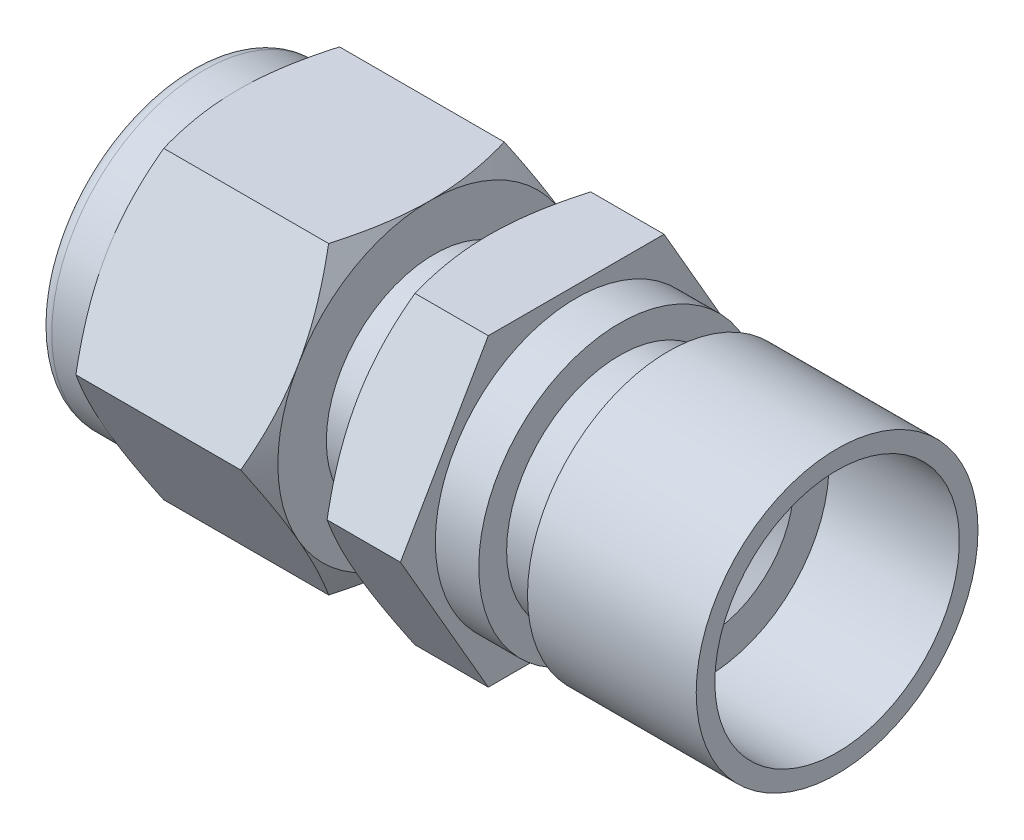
ISO-10303-21;
HEADER;
FILE_DESCRIPTION(('STEP AP214'),'2;1');
FILE_NAME('part.step','',(''),(''),'','','');
FILE_SCHEMA(('AUTOMOTIVE_DESIGN { 1 0 10303 214 1 1 1 1 }'));
ENDSEC;
DATA;
#1=APPLICATION_CONTEXT('core data for automotive mechanical design processes');
#2=APPLICATION_PROTOCOL_DEFINITION('international standard','automotive_design',2000,#1);
#3=PRODUCT_CONTEXT('',#1,'mechanical');
#4=PRODUCT('Part','Part','',(#3));
#5=PRODUCT_RELATED_PRODUCT_CATEGORY('part','',(#4));
#6=PRODUCT_DEFINITION_FORMATION('','',#4);
#7=PRODUCT_DEFINITION_CONTEXT('part definition',#1,'design');
#8=PRODUCT_DEFINITION('design','',#6,#7);
#9=PRODUCT_DEFINITION_SHAPE('','',#8);
#10=(LENGTH_UNIT() NAMED_UNIT(*) SI_UNIT(.MILLI.,.METRE.));
#11=(NAMED_UNIT(*) PLANE_ANGLE_UNIT() SI_UNIT($,.RADIAN.));
#12=(NAMED_UNIT(*) SI_UNIT($,.STERADIAN.) SOLID_ANGLE_UNIT());
#13=UNCERTAINTY_MEASURE_WITH_UNIT(LENGTH_MEASURE(1.E-05),#10,'distance_accuracy_value','');
#14=(GEOMETRIC_REPRESENTATION_CONTEXT(3) GLOBAL_UNCERTAINTY_ASSIGNED_CONTEXT((#13)) GLOBAL_UNIT_ASSIGNED_CONTEXT((#10,
#11,#12)) REPRESENTATION_CONTEXT('',''));
#15=CARTESIAN_POINT('',(0.,0.,0.));
#16=DIRECTION('',(0.,0.,1.));
#17=DIRECTION('',(1.,0.,0.));
#18=AXIS2_PLACEMENT_3D('',#15,#16,#17);
#19=CARTESIAN_POINT('',(17.5259999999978,0.,-12.8316097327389));
#20=DIRECTION('',(0.,0.500000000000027,-0.866025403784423));
#21=DIRECTION('',(0.,0.866025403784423,0.500000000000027));
#22=AXIS2_PLACEMENT_3D('',#19,#20,#21);
#23=PLANE('',#22);
#24=DIRECTION('',(1.,0.,0.));
#25=VECTOR('',#24,1.);
#26=CARTESIAN_POINT('',(17.5259999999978,1.86829718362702E-12,-12.83160973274));
#27=LINE('',#26,#25);
#28=CARTESIAN_POINT('',(4.49772846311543,-1.154187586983E-08,-12.8316097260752));
#29=VERTEX_POINT('',#28);
#30=CARTESIAN_POINT('',(16.5334715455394,3.7517137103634E-08,-12.8316097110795));
#31=VERTEX_POINT('',#30);
#32=EDGE_CURVE('E311',#29,#31,#27,.T.);
#33=ORIENTED_EDGE('',*,*,#32,.F.);
#34=CARTESIAN_POINT('',(4.49772845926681,2.3087743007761E-08,-12.8316097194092));
#35=CARTESIAN_POINT('',(4.34691704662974,0.452484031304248,-12.5703679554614));
#36=CARTESIAN_POINT('',(4.20876502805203,0.908289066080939,-12.307208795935));
#37=CARTESIAN_POINT('',(4.02589002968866,1.59559750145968,-11.9103910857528));
#38=CARTESIAN_POINT('',(3.96910063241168,1.82473210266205,-11.7781001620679));
#39=CARTESIAN_POINT('',(3.86429702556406,2.28450344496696,-11.5126510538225));
#40=CARTESIAN_POINT('',(3.81628228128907,2.51514009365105,-11.3794929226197));
#41=CARTESIAN_POINT('',(3.72979311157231,2.978042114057,-11.1122363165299));
#42=CARTESIAN_POINT('',(3.69133026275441,3.21030911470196,-10.9781369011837));
#43=CARTESIAN_POINT('',(3.62475292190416,3.67595403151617,-10.7092966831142));
#44=CARTESIAN_POINT('',(3.59663815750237,3.90933191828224,-10.5745558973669));
#45=CARTESIAN_POINT('',(3.55124676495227,4.37806313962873,-10.3039338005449));
#46=CARTESIAN_POINT('',(3.5340252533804,4.61342050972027,-10.1680501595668));
#47=CARTESIAN_POINT('',(3.51097789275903,5.08459812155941,-9.8960156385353));
#48=CARTESIAN_POINT('',(3.50515430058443,5.32041844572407,-9.75986471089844));
#49=CARTESIAN_POINT('',(3.50519999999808,5.55625000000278,-9.62370729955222));
#50=B_SPLINE_CURVE_WITH_KNOTS('',3,(#34,#35,#36,#37,#38,#39,#40,#41,#42,#43,#44,#45,#46,#47,#48,
#49),.UNSPECIFIED.,.F.,.F.,(4,2,2,2,2,2,2,4),(0.,1.63139646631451,2.44310867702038,
3.25477140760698,4.06741310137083,4.88003340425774,5.69673310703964,6.51359450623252),.UNSPECIFIED.);
#51=CARTESIAN_POINT('',(3.50519999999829,5.55625000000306,-9.62370729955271));
#52=VERTEX_POINT('',#51);
#53=EDGE_CURVE('E675',#29,#52,#50,.T.);
#54=ORIENTED_EDGE('',*,*,#53,.T.);
#55=CARTESIAN_POINT('',(3.50519999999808,5.55625000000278,-9.62370729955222));
#56=CARTESIAN_POINT('',(3.50515430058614,5.7920815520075,-9.48754988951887));
#57=CARTESIAN_POINT('',(3.51097789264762,6.0279018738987,-9.35139896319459));
#58=CARTESIAN_POINT('',(3.53402525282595,6.49907948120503,-9.07936444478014));
#59=CARTESIAN_POINT('',(3.55124676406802,6.7344368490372,-8.94348080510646));
#60=CARTESIAN_POINT('',(3.59663815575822,7.20316806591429,-8.67285871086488));
#61=CARTESIAN_POINT('',(3.62475291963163,7.43654595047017,-8.53811792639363));
#62=CARTESIAN_POINT('',(3.69133025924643,7.90219086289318,-8.2692777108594));
#63=CARTESIAN_POINT('',(3.72979310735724,8.13445786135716,-8.13517829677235));
#64=CARTESIAN_POINT('',(3.81628227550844,8.59735987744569,-7.86792169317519));
#65=CARTESIAN_POINT('',(3.8642970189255,8.82799652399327,-7.73476356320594));
#66=CARTESIAN_POINT('',(3.96910062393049,9.28776786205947,-7.46931445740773));
#67=CARTESIAN_POINT('',(4.02589002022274,9.51690246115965,-7.33702353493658));
#68=CARTESIAN_POINT('',(4.20876501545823,10.20421089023,-6.94020582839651));
#69=CARTESIAN_POINT('',(4.34691703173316,10.6600159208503,-6.67704667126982));
#70=CARTESIAN_POINT('',(4.49772844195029,11.1124999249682,-6.41580490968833));
#71=B_SPLINE_CURVE_WITH_KNOTS('',3,(#55,#56,#57,#58,#59,#60,#61,#62,#63,#64,#65,#66,#67,#68,#69,
#70),.UNSPECIFIED.,.F.,.F.,(4,2,2,2,2,2,2,4),(0.,0.816861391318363,1.63356108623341,
2.44618138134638,3.25882306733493,4.07048579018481,4.88219799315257,6.51359444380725),.UNSPECIFIED.);
#72=CARTESIAN_POINT('',(4.49772845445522,11.1124999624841,-6.41580488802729));
#73=VERTEX_POINT('',#72);
#74=EDGE_CURVE('E691',#52,#73,#71,.T.);
#75=ORIENTED_EDGE('',*,*,#74,.T.);
#76=DIRECTION('',(1.,0.,0.));
#77=VECTOR('',#76,1.);
#78=CARTESIAN_POINT('',(17.5259999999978,11.1125,-6.41580486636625));
#79=LINE('',#78,#77);
#80=CARTESIAN_POINT('',(16.5334715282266,11.1125,-6.41580488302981));
#81=VERTEX_POINT('',#80);
#82=EDGE_CURVE('E288',#81,#73,#79,.F.);
#83=ORIENTED_EDGE('',*,*,#82,.F.);
#84=CARTESIAN_POINT('',(16.5334715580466,11.1124999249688,-6.415804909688));
#85=CARTESIAN_POINT('',(16.6842829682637,10.6600159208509,-6.67704667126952));
#86=CARTESIAN_POINT('',(16.8224349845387,10.2042108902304,-6.94020582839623));
#87=CARTESIAN_POINT('',(17.0053099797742,9.51690246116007,-7.33702353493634));
#88=CARTESIAN_POINT('',(17.0620993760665,9.28776786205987,-7.4693144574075));
#89=CARTESIAN_POINT('',(17.1669029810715,8.82799652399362,-7.73476356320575));
#90=CARTESIAN_POINT('',(17.2149177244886,8.59735987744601,-7.86792169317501));
#91=CARTESIAN_POINT('',(17.3014068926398,8.13445786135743,-8.13517829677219));
#92=CARTESIAN_POINT('',(17.3398697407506,7.90219086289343,-8.26927771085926));
#93=CARTESIAN_POINT('',(17.4064470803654,7.43654595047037,-8.53811792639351));
#94=CARTESIAN_POINT('',(17.4345618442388,7.20316806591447,-8.67285871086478));
#95=CARTESIAN_POINT('',(17.479953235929,6.73443684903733,-8.94348080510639));
#96=CARTESIAN_POINT('',(17.4971747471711,6.49907948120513,-9.07936444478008));
#97=CARTESIAN_POINT('',(17.5202221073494,6.02790187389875,-9.35139896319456));
#98=CARTESIAN_POINT('',(17.5260456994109,5.79208155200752,-9.48754988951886));
#99=CARTESIAN_POINT('',(17.525999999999,5.55625000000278,-9.62370729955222));
#100=B_SPLINE_CURVE_WITH_KNOTS('',3,(#84,#85,#86,#87,#88,#89,#90,#91,#92,#93,#94,#95,#96,#97,
#98,#99),.UNSPECIFIED.,.F.,.F.,(4,2,2,2,2,2,2,4),(0.,1.63139645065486,2.4431086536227,
3.25477137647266,4.0674130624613,4.88003335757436,5.69673305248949,6.51359444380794),.UNSPECIFIED.);
#101=CARTESIAN_POINT('',(17.5259999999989,5.55625000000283,-9.62370729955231));
#102=VERTEX_POINT('',#101);
#103=EDGE_CURVE('E577',#81,#102,#100,.T.);
#104=ORIENTED_EDGE('',*,*,#103,.T.);
#105=CARTESIAN_POINT('',(17.525999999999,5.55625000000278,-9.62370729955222));
#106=CARTESIAN_POINT('',(17.5260456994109,5.32041844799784,-9.75986470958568));
#107=CARTESIAN_POINT('',(17.5202221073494,5.08459812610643,-9.89601563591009));
#108=CARTESIAN_POINT('',(17.4971747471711,4.61342051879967,-10.1680501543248));
#109=CARTESIAN_POINT('',(17.479953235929,4.37806315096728,-10.3039337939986));
#110=CARTESIAN_POINT('',(17.4345618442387,3.90933193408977,-10.5745558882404));
#111=CARTESIAN_POINT('',(17.4064470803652,3.67595404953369,-10.7092966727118));
#112=CARTESIAN_POINT('',(17.3398697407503,3.21030913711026,-10.9781368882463));
#113=CARTESIAN_POINT('',(17.3014068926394,2.97804213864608,-11.1122363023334));
#114=CARTESIAN_POINT('',(17.2149177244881,2.51514012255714,-11.3794929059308));
#115=CARTESIAN_POINT('',(17.1669029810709,2.28450347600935,-11.5126510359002));
#116=CARTESIAN_POINT('',(17.0620993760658,1.82473213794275,-11.7781001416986));
#117=CARTESIAN_POINT('',(17.0053099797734,1.59559753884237,-11.9103910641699));
#118=CARTESIAN_POINT('',(16.8224349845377,0.908289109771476,-12.3072087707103));
#119=CARTESIAN_POINT('',(16.6842829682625,0.452484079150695,-12.5703679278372));
#120=CARTESIAN_POINT('',(16.5334715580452,7.50324070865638E-08,-12.8316096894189));
#121=B_SPLINE_CURVE_WITH_KNOTS('',3,(#105,#106,#107,#108,#109,#110,#111,#112,#113,#114,#115,
#116,#117,#118,#119,#120),.UNSPECIFIED.,.F.,.F.,(4,2,2,2,2,2,2,4),(0.,0.816861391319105,
1.6335610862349,2.4461813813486,3.25882306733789,4.0704857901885,4.88219799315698,
6.51359444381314),.UNSPECIFIED.);
#122=EDGE_CURVE('E165',#102,#31,#121,.T.);
#123=ORIENTED_EDGE('',*,*,#122,.T.);
#124=EDGE_LOOP('',(#33,#54,#75,#83,#104,#123));
#125=FACE_BOUND('',#124,.T.);
#126=ADVANCED_FACE('F31',(#125),#23,.T.);
#127=CARTESIAN_POINT('',(17.5259999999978,-11.1125000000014,-6.41580486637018));
#128=DIRECTION('',(0.,-0.499999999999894,-0.8660254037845));
#129=DIRECTION('',(0.,0.8660254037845,-0.499999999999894));
#130=AXIS2_PLACEMENT_3D('',#127,#128,#129);
#131=PLANE('',#130);
#132=CARTESIAN_POINT('',(17.5259999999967,-5.55624999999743,-9.62370729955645));
#133=CARTESIAN_POINT('',(17.5260456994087,-5.79208155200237,-9.48754988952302));
#134=CARTESIAN_POINT('',(17.5202221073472,-6.0279018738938,-9.35139896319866));
#135=CARTESIAN_POINT('',(17.4971747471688,-6.49907948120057,-9.07936444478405));
#136=CARTESIAN_POINT('',(17.4799532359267,-6.73443684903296,-8.9434808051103));
#137=CARTESIAN_POINT('',(17.4345618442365,-7.20316806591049,-8.67285871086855));
#138=CARTESIAN_POINT('',(17.406447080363,-7.43654595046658,-8.53811792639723));
#139=CARTESIAN_POINT('',(17.3398697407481,-7.90219086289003,-8.26927771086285));
#140=CARTESIAN_POINT('',(17.3014068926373,-8.13445786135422,-8.13517829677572));
#141=CARTESIAN_POINT('',(17.214917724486,-8.59735987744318,-7.86792169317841));
#142=CARTESIAN_POINT('',(17.1669029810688,-8.82799652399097,-7.73476356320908));
#143=CARTESIAN_POINT('',(17.0620993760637,-9.2877678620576,-7.46931445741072));
#144=CARTESIAN_POINT('',(17.0053099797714,-9.51690246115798,-7.33702353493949));
#145=CARTESIAN_POINT('',(16.8224349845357,-10.2042108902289,-6.9402058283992));
#146=CARTESIAN_POINT('',(16.6842829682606,-10.6600159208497,-6.67704667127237));
#147=CARTESIAN_POINT('',(16.5334715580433,-11.112499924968,-6.41580490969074));
#148=B_SPLINE_CURVE_WITH_KNOTS('',3,(#132,#133,#134,#135,#136,#137,#138,#139,#140,#141,#142,
#143,#144,#145,#146,#147),.UNSPECIFIED.,.F.,.F.,(4,2,2,2,2,2,2,4),(0.,0.816861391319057,
1.6335610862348,2.44618138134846,3.2588230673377,4.07048579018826,4.8821979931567,
6.51359444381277),.UNSPECIFIED.);
#149=CARTESIAN_POINT('',(17.525999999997,-5.55624999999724,-9.62370729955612));
#150=VERTEX_POINT('',#149);
#151=CARTESIAN_POINT('',(16.533471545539,-11.1124999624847,-6.41580488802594));
#152=VERTEX_POINT('',#151);
#153=EDGE_CURVE('E740',#150,#152,#148,.T.);
#154=ORIENTED_EDGE('',*,*,#153,.T.);
#155=DIRECTION('',(1.,0.,0.));
#156=VECTOR('',#155,1.);
#157=CARTESIAN_POINT('',(17.5259999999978,-11.1125000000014,-6.41580486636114));
#158=LINE('',#157,#156);
#159=CARTESIAN_POINT('',(4.49772847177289,-11.1125000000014,-6.41580488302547));
#160=VERTEX_POINT('',#159);
#161=EDGE_CURVE('E305',#160,#152,#158,.T.);
#162=ORIENTED_EDGE('',*,*,#161,.F.);
#163=CARTESIAN_POINT('',(4.4977284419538,-11.1124999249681,-6.4158049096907));
#164=CARTESIAN_POINT('',(4.3469170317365,-10.6600159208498,-6.67704667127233));
#165=CARTESIAN_POINT('',(4.2087650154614,-10.204210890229,-6.94020582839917));
#166=CARTESIAN_POINT('',(4.02589002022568,-9.51690246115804,-7.33702353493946));
#167=CARTESIAN_POINT('',(3.96910062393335,-9.28776786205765,-7.46931445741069));
#168=CARTESIAN_POINT('',(3.86429701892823,-8.82799652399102,-7.73476356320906));
#169=CARTESIAN_POINT('',(3.81628227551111,-8.59735987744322,-7.86792169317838));
#170=CARTESIAN_POINT('',(3.72979310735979,-8.13445786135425,-8.13517829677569));
#171=CARTESIAN_POINT('',(3.69133025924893,-7.90219086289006,-8.26927771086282));
#172=CARTESIAN_POINT('',(3.62475291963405,-7.43654595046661,-8.53811792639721));
#173=CARTESIAN_POINT('',(3.59663815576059,-7.20316806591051,-8.67285871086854));
#174=CARTESIAN_POINT('',(3.55124676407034,-6.73443684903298,-8.94348080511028));
#175=CARTESIAN_POINT('',(3.53402525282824,-6.49907948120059,-9.07936444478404));
#176=CARTESIAN_POINT('',(3.51097789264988,-6.02790187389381,-9.35139896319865));
#177=CARTESIAN_POINT('',(3.50515430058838,-5.79208155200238,-9.48754988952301));
#178=CARTESIAN_POINT('',(3.50520000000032,-5.55624999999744,-9.62370729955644));
#179=B_SPLINE_CURVE_WITH_KNOTS('',3,(#163,#164,#165,#166,#167,#168,#169,#170,#171,#172,#173,
#174,#175,#176,#177,#178),.UNSPECIFIED.,.F.,.F.,(4,2,2,2,2,2,2,4),(0.,1.63139645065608,
2.44310865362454,3.25477137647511,4.06741306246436,4.88003335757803,5.69673305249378,
6.51359444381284),.UNSPECIFIED.);
#180=CARTESIAN_POINT('',(3.50519999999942,-5.55624999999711,-9.62370729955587));
#181=VERTEX_POINT('',#180);
#182=EDGE_CURVE('E670',#160,#181,#179,.T.);
#183=ORIENTED_EDGE('',*,*,#182,.T.);
#184=CARTESIAN_POINT('',(3.50520000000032,-5.55624999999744,-9.62370729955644));
#185=CARTESIAN_POINT('',(3.50515430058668,-5.32041844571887,-9.75986471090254));
#186=CARTESIAN_POINT('',(3.51097789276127,-5.08459812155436,-9.89601563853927));
#187=CARTESIAN_POINT('',(3.5340252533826,-4.6134205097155,-10.1680501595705));
#188=CARTESIAN_POINT('',(3.55124676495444,-4.37806313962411,-10.3039338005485));
#189=CARTESIAN_POINT('',(3.59663815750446,-3.9093319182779,-10.5745558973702));
#190=CARTESIAN_POINT('',(3.6247529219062,-3.67595403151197,-10.7092966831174));
#191=CARTESIAN_POINT('',(3.69133026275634,-3.21030911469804,-10.9781369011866));
#192=CARTESIAN_POINT('',(3.72979311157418,-2.9780421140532,-11.1122363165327));
#193=CARTESIAN_POINT('',(3.8162822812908,-2.51514009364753,-11.3794929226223));
#194=CARTESIAN_POINT('',(3.86429702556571,-2.28450344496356,-11.5126510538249));
#195=CARTESIAN_POINT('',(3.96910063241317,-1.82473210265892,-11.7781001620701));
#196=CARTESIAN_POINT('',(4.02589002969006,-1.59559750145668,-11.9103910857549));
#197=CARTESIAN_POINT('',(4.20876502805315,-0.908289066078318,-12.3072087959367));
#198=CARTESIAN_POINT('',(4.34691704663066,-0.45248403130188,-12.5703679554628));
#199=CARTESIAN_POINT('',(4.49772845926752,-2.30856199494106E-08,-12.8316097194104));
#200=B_SPLINE_CURVE_WITH_KNOTS('',3,(#184,#185,#186,#187,#188,#189,#190,#191,#192,#193,#194,
#195,#196,#197,#198,#199),.UNSPECIFIED.,.F.,.F.,(4,2,2,2,2,2,2,4),(0.,0.816861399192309,
1.63356110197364,2.44618140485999,3.25882309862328,4.07048582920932,4.88219803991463,
6.51359450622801),.UNSPECIFIED.);
#201=EDGE_CURVE('E680',#181,#29,#200,.T.);
#202=ORIENTED_EDGE('',*,*,#201,.T.);
#203=ORIENTED_EDGE('',*,*,#32,.T.);
#204=CARTESIAN_POINT('',(16.5334715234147,2.8858939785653E-08,-12.8316097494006));
#205=CARTESIAN_POINT('',(16.6842829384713,-0.452483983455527,-12.5703679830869));
#206=CARTESIAN_POINT('',(16.8224349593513,-0.908289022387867,-12.3072088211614));
#207=CARTESIAN_POINT('',(17.005309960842,-1.59559746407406,-11.9103911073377));
#208=CARTESIAN_POINT('',(17.0620993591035,-1.82473206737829,-11.7781001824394));
#209=CARTESIAN_POINT('',(17.1669029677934,-2.28450341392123,-11.5126510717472));
#210=CARTESIAN_POINT('',(17.2149177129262,-2.51514006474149,-11.3794929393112));
#211=CARTESIAN_POINT('',(17.3014068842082,-2.97804208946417,-11.1122363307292));
#212=CARTESIAN_POINT('',(17.3398697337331,-3.21030909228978,-10.978136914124));
#213=CARTESIAN_POINT('',(17.4064470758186,-3.67595401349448,-10.7092966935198));
#214=CARTESIAN_POINT('',(17.4345618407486,-3.9093319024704,-10.5745559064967));
#215=CARTESIAN_POINT('',(17.4799532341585,-4.37806312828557,-10.3039338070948));
#216=CARTESIAN_POINT('',(17.4971747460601,-4.61342050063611,-10.1680501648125));
#217=CARTESIAN_POINT('',(17.5202221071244,-5.08459811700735,-9.89601564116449));
#218=CARTESIAN_POINT('',(17.5260456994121,-5.3204184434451,-9.75986471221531));
#219=CARTESIAN_POINT('',(17.5259999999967,-5.55624999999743,-9.62370729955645));
#220=B_SPLINE_CURVE_WITH_KNOTS('',3,(#204,#205,#206,#207,#208,#209,#210,#211,#212,#213,#214,
#215,#216,#217,#218,#219),.UNSPECIFIED.,.F.,.F.,(4,2,2,2,2,2,2,4),(0.,1.63139648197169,
2.44310870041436,3.25477143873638,4.06741314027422,4.88003345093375,5.69673316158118,
6.51359456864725),.UNSPECIFIED.);
#221=EDGE_CURVE('E747',#31,#150,#220,.T.);
#222=ORIENTED_EDGE('',*,*,#221,.T.);
#223=EDGE_LOOP('',(#154,#162,#183,#202,#203,#222));
#224=FACE_BOUND('',#223,.T.);
#225=ADVANCED_FACE('F630',(#224),#131,.T.);
#226=CARTESIAN_POINT('',(17.5259999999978,-11.1125000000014,6.41580486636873));
#227=DIRECTION('',(0.,-1.,0.));
#228=DIRECTION('',(1.,0.,0.));
#229=AXIS2_PLACEMENT_3D('',#226,#227,#228);
#230=PLANE('',#229);
#231=CARTESIAN_POINT('',(17.525999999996,-11.1125000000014,1.44351006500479E-12));
#232=CARTESIAN_POINT('',(17.5260456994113,-11.1125000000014,0.272314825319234));
#233=CARTESIAN_POINT('',(17.5202221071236,-11.1125000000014,0.544616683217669));
#234=CARTESIAN_POINT('',(17.4971747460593,-11.1125000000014,1.08868573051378));
#235=CARTESIAN_POINT('',(17.4799532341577,-11.1125000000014,1.36045301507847));
#236=CARTESIAN_POINT('',(17.4345618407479,-11.1125000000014,1.90169721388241));
#237=CARTESIAN_POINT('',(17.4064470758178,-11.1125000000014,2.17117878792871));
#238=CARTESIAN_POINT('',(17.3398697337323,-11.1125000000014,2.70885922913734));
#239=CARTESIAN_POINT('',(17.3014068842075,-11.1125000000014,2.97705806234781));
#240=CARTESIAN_POINT('',(17.2149177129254,-11.1125000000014,3.51157127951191));
#241=CARTESIAN_POINT('',(17.1669029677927,-11.1125000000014,3.77788754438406));
#242=CARTESIAN_POINT('',(17.0620993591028,-11.1125000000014,4.30878576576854));
#243=CARTESIAN_POINT('',(17.0053099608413,-11.1125000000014,4.57336761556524));
#244=CARTESIAN_POINT('',(16.8224349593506,-11.1125000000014,5.36700304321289));
#245=CARTESIAN_POINT('',(16.6842829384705,-11.1125000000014,5.89332136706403));
#246=CARTESIAN_POINT('',(16.5334715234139,-11.1125000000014,6.41580489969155));
#247=B_SPLINE_CURVE_WITH_KNOTS('',3,(#231,#232,#233,#234,#235,#236,#237,#238,#239,#240,#241,
#242,#243,#244,#245,#246),.UNSPECIFIED.,.F.,.F.,(4,2,2,2,2,2,2,4),(0.,0.816861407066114,
1.63356111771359,2.44618142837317,3.25882312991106,4.07048586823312,4.88219808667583,
6.51359456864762),.UNSPECIFIED.);
#248=CARTESIAN_POINT('',(17.5259999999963,-11.1125000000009,1.44247279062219E-12));
#249=VERTEX_POINT('',#248);
#250=CARTESIAN_POINT('',(16.5334715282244,-11.1124999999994,6.41580488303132));
#251=VERTEX_POINT('',#250);
#252=EDGE_CURVE('E614',#249,#251,#247,.T.);
#253=ORIENTED_EDGE('',*,*,#252,.T.);
#254=DIRECTION('',(1.,0.,0.));
#255=VECTOR('',#254,1.);
#256=CARTESIAN_POINT('',(17.5259999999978,-11.1124999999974,6.41580486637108));
#257=LINE('',#256,#255);
#258=CARTESIAN_POINT('',(4.49772847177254,-11.1125000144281,6.41580485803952));
#259=VERTEX_POINT('',#258);
#260=EDGE_CURVE('E298',#259,#251,#257,.T.);
#261=ORIENTED_EDGE('',*,*,#260,.F.);
#262=CARTESIAN_POINT('',(4.49772844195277,-11.1125000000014,6.41580477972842));
#263=CARTESIAN_POINT('',(4.34691703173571,-11.1125000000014,5.8933212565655));
#264=CARTESIAN_POINT('',(4.20876501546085,-11.1125000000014,5.36700294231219));
#265=CARTESIAN_POINT('',(4.02589002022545,-11.1125000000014,4.57336752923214));
#266=CARTESIAN_POINT('',(3.96910062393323,-11.1125000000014,4.30878568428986));
#267=CARTESIAN_POINT('',(3.8642970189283,-11.1125000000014,3.7778874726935));
#268=CARTESIAN_POINT('',(3.81628227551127,-11.1125000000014,3.51157121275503));
#269=CARTESIAN_POINT('',(3.72979310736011,-11.1125000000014,2.97705800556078));
#270=CARTESIAN_POINT('',(3.69133025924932,-11.1125000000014,2.70885917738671));
#271=CARTESIAN_POINT('',(3.62475291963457,-11.1125000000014,2.17117874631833));
#272=CARTESIAN_POINT('',(3.59663815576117,-11.1125000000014,1.90169717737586));
#273=CARTESIAN_POINT('',(3.551246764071,-11.1125000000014,1.36045298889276));
#274=CARTESIAN_POINT('',(3.53402525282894,-11.1125000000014,1.08868570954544));
#275=CARTESIAN_POINT('',(3.51097789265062,-11.1125000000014,0.544616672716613));
#276=CARTESIAN_POINT('',(3.50515430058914,-11.1125000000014,0.272314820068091));
#277=CARTESIAN_POINT('',(3.50520000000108,-11.1125000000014,1.44341228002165E-12));
#278=B_SPLINE_CURVE_WITH_KNOTS('',3,(#262,#263,#264,#265,#266,#267,#268,#269,#270,#271,#272,
#273,#274,#275,#276,#277),.UNSPECIFIED.,.F.,.F.,(4,2,2,2,2,2,2,4),(0.,1.63139645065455,
2.44310865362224,3.25477137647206,4.06741306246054,4.88003335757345,5.69673305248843,
6.51359444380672),.UNSPECIFIED.);
#279=CARTESIAN_POINT('',(3.5051999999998,-11.1125000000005,1.44454788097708E-12));
#280=VERTEX_POINT('',#279);
#281=EDGE_CURVE('E645',#259,#280,#278,.T.);
#282=ORIENTED_EDGE('',*,*,#281,.T.);
#283=CARTESIAN_POINT('',(3.50520000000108,-11.1125000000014,1.44567702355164E-12));
#284=CARTESIAN_POINT('',(3.50515430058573,-11.1125000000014,-0.272314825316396));
#285=CARTESIAN_POINT('',(3.51097789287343,-11.1125000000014,-0.544616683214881));
#286=CARTESIAN_POINT('',(3.53402525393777,-11.1125000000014,-1.08868573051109));
#287=CARTESIAN_POINT('',(3.55124676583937,-11.1125000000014,-1.36045301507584));
#288=CARTESIAN_POINT('',(3.59663815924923,-11.1125000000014,-1.90169721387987));
#289=CARTESIAN_POINT('',(3.6247529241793,-11.1125000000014,-2.17117878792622));
#290=CARTESIAN_POINT('',(3.6913302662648,-11.1125000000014,-2.70885922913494));
#291=CARTESIAN_POINT('',(3.72979311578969,-11.1125000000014,-2.97705806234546));
#292=CARTESIAN_POINT('',(3.81628228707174,-11.1125000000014,-3.51157127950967));
#293=CARTESIAN_POINT('',(3.86429703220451,-11.1125000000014,-3.77788754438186));
#294=CARTESIAN_POINT('',(3.96910064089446,-11.1125000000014,-4.30878576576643));
#295=CARTESIAN_POINT('',(4.02589003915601,-11.1125000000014,-4.57336761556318));
#296=CARTESIAN_POINT('',(4.20876504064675,-11.1125000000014,-5.36700304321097));
#297=CARTESIAN_POINT('',(4.34691706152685,-11.1125000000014,-5.8933213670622));
#298=CARTESIAN_POINT('',(4.49772847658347,-11.1125000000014,-6.41580489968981));
#299=B_SPLINE_CURVE_WITH_KNOTS('',3,(#283,#284,#285,#286,#287,#288,#289,#290,#291,#292,#293,
#294,#295,#296,#297,#298),.UNSPECIFIED.,.F.,.F.,(4,2,2,2,2,2,2,4),(0.,0.816861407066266,
1.6335611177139,2.44618142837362,3.25882312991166,4.07048586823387,4.88219808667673,
6.51359456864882),.UNSPECIFIED.);
#300=EDGE_CURVE('E637',#280,#160,#299,.T.);
#301=ORIENTED_EDGE('',*,*,#300,.T.);
#302=ORIENTED_EDGE('',*,*,#161,.T.);
#303=CARTESIAN_POINT('',(16.5334715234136,-11.1125000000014,-6.41580489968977));
#304=CARTESIAN_POINT('',(16.6842829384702,-11.1125000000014,-5.89332136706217));
#305=CARTESIAN_POINT('',(16.8224349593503,-11.1125000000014,-5.36700304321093));
#306=CARTESIAN_POINT('',(17.0053099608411,-11.1125000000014,-4.57336761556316));
#307=CARTESIAN_POINT('',(17.0620993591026,-11.1125000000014,-4.30878576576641));
#308=CARTESIAN_POINT('',(17.1669029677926,-11.1125000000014,-3.77788754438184));
#309=CARTESIAN_POINT('',(17.2149177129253,-11.1125000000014,-3.51157127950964));
#310=CARTESIAN_POINT('',(17.3014068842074,-11.1125000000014,-2.97705806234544));
#311=CARTESIAN_POINT('',(17.3398697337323,-11.1125000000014,-2.70885922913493));
#312=CARTESIAN_POINT('',(17.4064470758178,-11.1125000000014,-2.17117878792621));
#313=CARTESIAN_POINT('',(17.4345618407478,-11.1125000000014,-1.90169721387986));
#314=CARTESIAN_POINT('',(17.4799532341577,-11.1125000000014,-1.36045301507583));
#315=CARTESIAN_POINT('',(17.4971747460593,-11.1125000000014,-1.08868573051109));
#316=CARTESIAN_POINT('',(17.5202221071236,-11.1125000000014,-0.54461668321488));
#317=CARTESIAN_POINT('',(17.5260456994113,-11.1125000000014,-0.272314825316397));
#318=CARTESIAN_POINT('',(17.525999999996,-11.1125000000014,1.44219666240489E-12));
#319=B_SPLINE_CURVE_WITH_KNOTS('',3,(#303,#304,#305,#306,#307,#308,#309,#310,#311,#312,#313,
#314,#315,#316,#317,#318),.UNSPECIFIED.,.F.,.F.,(4,2,2,2,2,2,2,4),(0.,1.63139648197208,
2.44310870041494,3.25477143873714,4.06741314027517,4.88003345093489,5.69673316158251,
6.51359456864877),.UNSPECIFIED.);
#320=EDGE_CURVE('E742',#152,#249,#319,.T.);
#321=ORIENTED_EDGE('',*,*,#320,.T.);
#322=EDGE_LOOP('',(#253,#261,#282,#301,#302,#321));
#323=FACE_BOUND('',#322,.T.);
#324=ADVANCED_FACE('F626',(#323),#230,.T.);
#325=CARTESIAN_POINT('',(17.5259999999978,-1.44382283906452E-12,12.8316097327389));
#326=DIRECTION('',(0.,-0.500000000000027,0.866025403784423));
#327=DIRECTION('',(0.,-0.866025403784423,-0.500000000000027));
#328=AXIS2_PLACEMENT_3D('',#325,#326,#327);
#329=PLANE('',#328);
#330=CARTESIAN_POINT('',(17.5259999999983,-5.55624999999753,9.62370729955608));
#331=CARTESIAN_POINT('',(17.5260456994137,-5.32041844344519,9.75986471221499));
#332=CARTESIAN_POINT('',(17.520222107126,-5.08459811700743,9.89601564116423));
#333=CARTESIAN_POINT('',(17.4971747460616,-4.61342050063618,10.1680501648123));
#334=CARTESIAN_POINT('',(17.47995323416,-4.37806312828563,10.3039338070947));
#335=CARTESIAN_POINT('',(17.4345618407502,-3.90933190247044,10.5745559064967));
#336=CARTESIAN_POINT('',(17.4064470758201,-3.67595401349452,10.7092966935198));
#337=CARTESIAN_POINT('',(17.3398697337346,-3.2103090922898,10.9781369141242));
#338=CARTESIAN_POINT('',(17.3014068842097,-2.97804208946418,11.1122363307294));
#339=CARTESIAN_POINT('',(17.2149177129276,-2.51514006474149,11.3794929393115));
#340=CARTESIAN_POINT('',(17.1669029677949,-2.28450341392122,11.5126510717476));
#341=CARTESIAN_POINT('',(17.0620993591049,-1.82473206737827,11.7781001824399));
#342=CARTESIAN_POINT('',(17.0053099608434,-1.59559746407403,11.9103911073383));
#343=CARTESIAN_POINT('',(16.8224349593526,-0.908289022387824,12.3072088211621));
#344=CARTESIAN_POINT('',(16.6842829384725,-0.452483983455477,12.5703679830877));
#345=CARTESIAN_POINT('',(16.5334715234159,2.88590009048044E-08,12.8316097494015));
#346=B_SPLINE_CURVE_WITH_KNOTS('',3,(#330,#331,#332,#333,#334,#335,#336,#337,#338,#339,#340,
#341,#342,#343,#344,#345),.UNSPECIFIED.,.F.,.F.,(4,2,2,2,2,2,2,4),(0.,0.816861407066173,
1.63356111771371,2.44618142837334,3.25882312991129,4.07048586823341,4.88219808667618,
6.51359456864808),.UNSPECIFIED.);
#347=CARTESIAN_POINT('',(17.5259999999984,-5.55624999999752,9.62370729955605));
#348=VERTEX_POINT('',#347);
#349=CARTESIAN_POINT('',(16.5334715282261,1.44298927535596E-08,12.83160974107));
#350=VERTEX_POINT('',#349);
#351=EDGE_CURVE('E605',#348,#350,#346,.T.);
#352=ORIENTED_EDGE('',*,*,#351,.T.);
#353=DIRECTION('',(1.,0.,0.));
#354=VECTOR('',#353,1.);
#355=CARTESIAN_POINT('',(17.5259999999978,7.84095011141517E-13,12.8316097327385));
#356=LINE('',#355,#354);
#357=CARTESIAN_POINT('',(4.49772847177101,-1.44298562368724E-08,12.83160974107));
#358=VERTEX_POINT('',#357);
#359=EDGE_CURVE('E286',#358,#350,#356,.T.);
#360=ORIENTED_EDGE('',*,*,#359,.F.);
#361=CARTESIAN_POINT('',(4.49772844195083,-7.50321370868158E-08,12.8316096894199));
#362=CARTESIAN_POINT('',(4.34691703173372,-0.45248407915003,12.5703679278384));
#363=CARTESIAN_POINT('',(4.2087650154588,-0.908289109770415,12.3072087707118));
#364=CARTESIAN_POINT('',(4.02589002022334,-1.59559753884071,11.9103910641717));
#365=CARTESIAN_POINT('',(3.96910062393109,-1.82473213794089,11.7781001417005));
#366=CARTESIAN_POINT('',(3.86429701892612,-2.28450347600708,11.5126510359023));
#367=CARTESIAN_POINT('',(3.81628227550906,-2.51514012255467,11.3794929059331));
#368=CARTESIAN_POINT('',(3.72979310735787,-2.97804213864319,11.1122363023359));
#369=CARTESIAN_POINT('',(3.69133025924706,-3.21030913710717,10.9781368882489));
#370=CARTESIAN_POINT('',(3.62475291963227,-3.67595404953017,10.7092966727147));
#371=CARTESIAN_POINT('',(3.59663815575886,-3.90933193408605,10.5745558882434));
#372=CARTESIAN_POINT('',(3.55124676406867,-4.37806315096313,10.3039337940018));
#373=CARTESIAN_POINT('',(3.5340252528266,-4.6134205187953,10.1680501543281));
#374=CARTESIAN_POINT('',(3.51097789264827,-5.08459812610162,9.8960156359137));
#375=CARTESIAN_POINT('',(3.50515430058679,-5.32041844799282,9.75986470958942));
#376=CARTESIAN_POINT('',(3.50519999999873,-5.55624999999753,9.62370729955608));
#377=B_SPLINE_CURVE_WITH_KNOTS('',3,(#361,#362,#363,#364,#365,#366,#367,#368,#369,#370,#371,
#372,#373,#374,#375,#376),.UNSPECIFIED.,.F.,.F.,(4,2,2,2,2,2,2,4),(0.,1.63139645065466,
2.4431086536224,3.25477137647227,4.06741306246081,4.88003335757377,5.6967330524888,
6.51359444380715),.UNSPECIFIED.);
#378=CARTESIAN_POINT('',(3.50519999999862,-5.55624999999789,9.62370729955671));
#379=VERTEX_POINT('',#378);
#380=EDGE_CURVE('E723',#358,#379,#377,.T.);
#381=ORIENTED_EDGE('',*,*,#380,.T.);
#382=CARTESIAN_POINT('',(3.50519999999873,-5.55624999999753,9.62370729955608));
#383=CARTESIAN_POINT('',(3.50515430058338,-5.79208155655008,9.48754988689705));
#384=CARTESIAN_POINT('',(3.51097789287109,-6.02790188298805,9.3513989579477));
#385=CARTESIAN_POINT('',(3.53402525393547,-6.49907949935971,9.07936443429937));
#386=CARTESIAN_POINT('',(3.55124676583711,-6.73443687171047,8.94348079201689));
#387=CARTESIAN_POINT('',(3.59663815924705,-7.20316809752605,8.67285869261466));
#388=CARTESIAN_POINT('',(3.62475292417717,-7.43654598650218,8.53811790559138));
#389=CARTESIAN_POINT('',(3.69133026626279,-7.90219090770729,8.2692776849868));
#390=CARTESIAN_POINT('',(3.72979311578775,-8.13445791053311,8.13517826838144));
#391=CARTESIAN_POINT('',(3.81628228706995,-8.59735993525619,7.86792165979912));
#392=CARTESIAN_POINT('',(3.8642970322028,-8.82799658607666,7.73476352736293));
#393=CARTESIAN_POINT('',(3.96910064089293,-9.28776793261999,7.46931441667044));
#394=CARTESIAN_POINT('',(4.02589003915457,-9.51690253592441,7.33702349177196));
#395=CARTESIAN_POINT('',(4.20876504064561,-10.2042109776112,6.94020577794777));
#396=CARTESIAN_POINT('',(4.34691706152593,-10.6600160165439,6.67704661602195));
#397=CARTESIAN_POINT('',(4.49772847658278,-11.1125000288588,6.41580484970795));
#398=B_SPLINE_CURVE_WITH_KNOTS('',3,(#382,#383,#384,#385,#386,#387,#388,#389,#390,#391,#392,
#393,#394,#395,#396,#397),.UNSPECIFIED.,.F.,.F.,(4,2,2,2,2,2,2,4),(0.,0.816861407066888,
1.63356111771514,2.44618142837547,3.25882312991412,4.07048586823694,4.88219808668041,
6.51359456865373),.UNSPECIFIED.);
#399=EDGE_CURVE('E651',#379,#259,#398,.T.);
#400=ORIENTED_EDGE('',*,*,#399,.T.);
#401=ORIENTED_EDGE('',*,*,#260,.T.);
#402=CARTESIAN_POINT('',(16.5334715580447,-11.1124999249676,6.41580490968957));
#403=CARTESIAN_POINT('',(16.684282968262,-10.6600159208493,6.67704667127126));
#404=CARTESIAN_POINT('',(16.8224349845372,-10.2042108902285,6.94020582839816));
#405=CARTESIAN_POINT('',(17.0053099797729,-9.51690246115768,7.33702353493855));
#406=CARTESIAN_POINT('',(17.0620993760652,-9.28776786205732,7.46931445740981));
#407=CARTESIAN_POINT('',(17.1669029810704,-8.82799652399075,7.73476356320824));
#408=CARTESIAN_POINT('',(17.2149177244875,-8.59735987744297,7.8679216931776));
#409=CARTESIAN_POINT('',(17.3014068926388,-8.13445786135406,8.13517829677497));
#410=CARTESIAN_POINT('',(17.3398697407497,-7.9021908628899,8.26927771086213));
#411=CARTESIAN_POINT('',(17.4064470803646,-7.4365459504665,8.53811792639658));
#412=CARTESIAN_POINT('',(17.4345618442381,-7.20316806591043,8.67285871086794));
#413=CARTESIAN_POINT('',(17.4799532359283,-6.73443684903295,8.94348080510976));
#414=CARTESIAN_POINT('',(17.4971747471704,-6.49907948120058,9.07936444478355));
#415=CARTESIAN_POINT('',(17.5202221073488,-6.02790187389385,9.35139896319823));
#416=CARTESIAN_POINT('',(17.5260456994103,-5.79208155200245,9.48754988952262));
#417=CARTESIAN_POINT('',(17.5259999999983,-5.55624999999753,9.62370729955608));
#418=B_SPLINE_CURVE_WITH_KNOTS('',3,(#402,#403,#404,#405,#406,#407,#408,#409,#410,#411,#412,
#413,#414,#415,#416,#417),.UNSPECIFIED.,.F.,.F.,(4,2,2,2,2,2,2,4),(0.,1.63139645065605,
2.44310865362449,3.25477137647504,4.06741306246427,4.88003335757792,5.69673305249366,
6.51359444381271),.UNSPECIFIED.);
#419=EDGE_CURVE('E621',#251,#348,#418,.T.);
#420=ORIENTED_EDGE('',*,*,#419,.T.);
#421=EDGE_LOOP('',(#352,#360,#381,#400,#401,#420));
#422=FACE_BOUND('',#421,.T.);
#423=ADVANCED_FACE('F629',(#422),#329,.T.);
#424=CARTESIAN_POINT('',(17.5259999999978,11.1125,-6.41580486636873));
#425=DIRECTION('',(0.,1.,0.));
#426=DIRECTION('',(0.,0.,1.));
#427=AXIS2_PLACEMENT_3D('',#424,#425,#426);
#428=PLANE('',#427);
#429=ORIENTED_EDGE('',*,*,#82,.T.);
#430=CARTESIAN_POINT('',(4.49772847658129,11.1125,-6.41580489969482));
#431=CARTESIAN_POINT('',(4.34691706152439,11.1125,-5.89332136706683));
#432=CARTESIAN_POINT('',(4.20876504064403,11.1125,-5.3670030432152));
#433=CARTESIAN_POINT('',(4.02589003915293,11.1125,-4.57336761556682));
#434=CARTESIAN_POINT('',(3.96910064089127,11.1125,-4.30878576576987));
#435=CARTESIAN_POINT('',(3.86429703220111,11.1125,-3.77788754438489));
#436=CARTESIAN_POINT('',(3.81628228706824,11.1125,-3.51157127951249));
#437=CARTESIAN_POINT('',(3.729793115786,11.1125,-2.97705806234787));
#438=CARTESIAN_POINT('',(3.69133026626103,11.1125,-2.70885922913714));
#439=CARTESIAN_POINT('',(3.62475292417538,11.1125,-2.17117878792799));
#440=CARTESIAN_POINT('',(3.59663815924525,11.1125,-1.90169721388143));
#441=CARTESIAN_POINT('',(3.55124676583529,11.1125,-1.36045301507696));
#442=CARTESIAN_POINT('',(3.53402525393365,11.1125,-1.08868573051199));
#443=CARTESIAN_POINT('',(3.51097789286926,11.1125,-0.544616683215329));
#444=CARTESIAN_POINT('',(3.50515430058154,11.1125,-0.272314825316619));
#445=CARTESIAN_POINT('',(3.50519999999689,11.1125,1.44741246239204E-12));
#446=B_SPLINE_CURVE_WITH_KNOTS('',3,(#430,#431,#432,#433,#434,#435,#436,#437,#438,#439,#440,
#441,#442,#443,#444,#445),.UNSPECIFIED.,.F.,.F.,(4,2,2,2,2,2,2,4),(0.,1.63139648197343,
2.44310870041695,3.25477143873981,4.06741314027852,4.8800334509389,5.6967331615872,
6.51359456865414),.UNSPECIFIED.);
#447=CARTESIAN_POINT('',(3.5051999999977,11.1125000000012,1.44711433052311E-12));
#448=VERTEX_POINT('',#447);
#449=EDGE_CURVE('E686',#73,#448,#446,.T.);
#450=ORIENTED_EDGE('',*,*,#449,.T.);
#451=CARTESIAN_POINT('',(3.50519999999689,11.1125,1.4472579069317E-12));
#452=CARTESIAN_POINT('',(3.50515430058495,11.1125,0.272314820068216));
#453=CARTESIAN_POINT('',(3.51097789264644,11.1125,0.54461667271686));
#454=CARTESIAN_POINT('',(3.53402525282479,11.1125,1.08868570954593));
#455=CARTESIAN_POINT('',(3.55124676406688,11.1125,1.36045298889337));
#456=CARTESIAN_POINT('',(3.59663815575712,11.1125,1.90169717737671));
#457=CARTESIAN_POINT('',(3.62475291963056,11.1125,2.17117874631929));
#458=CARTESIAN_POINT('',(3.69133025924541,11.1125,2.7088591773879));
#459=CARTESIAN_POINT('',(3.72979310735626,11.1125,2.97705800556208));
#460=CARTESIAN_POINT('',(3.81628227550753,11.1125,3.51157121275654));
#461=CARTESIAN_POINT('',(3.86429701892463,11.1125,3.77788747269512));
#462=CARTESIAN_POINT('',(3.9691006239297,11.1125,4.3087856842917));
#463=CARTESIAN_POINT('',(4.025890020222,11.1125,4.57336752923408));
#464=CARTESIAN_POINT('',(4.20876501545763,11.1125,5.36700294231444));
#465=CARTESIAN_POINT('',(4.34691703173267,11.1125,5.89332125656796));
#466=CARTESIAN_POINT('',(4.4977284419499,11.1125,6.41580477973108));
#467=B_SPLINE_CURVE_WITH_KNOTS('',3,(#451,#452,#453,#454,#455,#456,#457,#458,#459,#460,#461,
#462,#463,#464,#465,#466),.UNSPECIFIED.,.F.,.F.,(4,2,2,2,2,2,2,4),(0.,0.816861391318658,
1.633561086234,2.44618138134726,3.25882306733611,4.07048579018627,4.88219799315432,
6.51359444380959),.UNSPECIFIED.);
#468=CARTESIAN_POINT('',(4.49772845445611,11.1125000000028,6.41580482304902));
#469=VERTEX_POINT('',#468);
#470=EDGE_CURVE('E538',#448,#469,#467,.T.);
#471=ORIENTED_EDGE('',*,*,#470,.T.);
#472=DIRECTION('',(1.,0.,0.));
#473=VECTOR('',#472,1.);
#474=CARTESIAN_POINT('',(17.5259999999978,11.1125000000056,6.41580486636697));
#475=LINE('',#474,#473);
#476=CARTESIAN_POINT('',(16.5334715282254,11.1125000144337,6.4158048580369));
#477=VERTEX_POINT('',#476);
#478=EDGE_CURVE('E283',#477,#469,#475,.F.);
#479=ORIENTED_EDGE('',*,*,#478,.F.);
#480=CARTESIAN_POINT('',(16.5334715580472,11.1125,6.41580477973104));
#481=CARTESIAN_POINT('',(16.6842829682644,11.1125,5.89332125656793));
#482=CARTESIAN_POINT('',(16.8224349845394,11.1125,5.36700294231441));
#483=CARTESIAN_POINT('',(17.0053099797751,11.1125,4.57336752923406));
#484=CARTESIAN_POINT('',(17.0620993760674,11.1125,4.30878568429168));
#485=CARTESIAN_POINT('',(17.1669029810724,11.1125,3.7778874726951));
#486=CARTESIAN_POINT('',(17.2149177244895,11.1125,3.51157121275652));
#487=CARTESIAN_POINT('',(17.3014068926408,11.1125,2.97705800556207));
#488=CARTESIAN_POINT('',(17.3398697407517,11.1125,2.70885917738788));
#489=CARTESIAN_POINT('',(17.4064470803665,11.1125,2.17117874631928));
#490=CARTESIAN_POINT('',(17.43456184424,11.1125,1.9016971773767));
#491=CARTESIAN_POINT('',(17.4799532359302,11.1125,1.36045298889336));
#492=CARTESIAN_POINT('',(17.4971747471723,11.1125,1.08868570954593));
#493=CARTESIAN_POINT('',(17.5202221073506,11.1125,0.54461667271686));
#494=CARTESIAN_POINT('',(17.5260456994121,11.1125,0.272314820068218));
#495=CARTESIAN_POINT('',(17.5260000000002,11.1125,1.45042068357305E-12));
#496=B_SPLINE_CURVE_WITH_KNOTS('',3,(#480,#481,#482,#483,#484,#485,#486,#487,#488,#489,#490,
#491,#492,#493,#494,#495),.UNSPECIFIED.,.F.,.F.,(4,2,2,2,2,2,2,4),(0.,1.63139645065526,
2.4431086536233,3.25477137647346,4.0674130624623,4.88003335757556,5.69673305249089,
6.51359444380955),.UNSPECIFIED.);
#497=CARTESIAN_POINT('',(17.526,11.1125000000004,1.44883735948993E-12));
#498=VERTEX_POINT('',#497);
#499=EDGE_CURVE('E578',#477,#498,#496,.T.);
#500=ORIENTED_EDGE('',*,*,#499,.T.);
#501=CARTESIAN_POINT('',(17.5260000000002,11.1125,1.44722159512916E-12));
#502=CARTESIAN_POINT('',(17.5260456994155,11.1125,-0.272314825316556));
#503=CARTESIAN_POINT('',(17.5202221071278,11.1125,-0.544616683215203));
#504=CARTESIAN_POINT('',(17.4971747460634,11.1125,-1.08868573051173));
#505=CARTESIAN_POINT('',(17.4799532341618,11.1125,-1.36045301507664));
#506=CARTESIAN_POINT('',(17.4345618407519,11.1125,-1.90169721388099));
#507=CARTESIAN_POINT('',(17.4064470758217,11.1125,-2.17117878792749));
#508=CARTESIAN_POINT('',(17.3398697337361,11.1125,-2.70885922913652));
#509=CARTESIAN_POINT('',(17.3014068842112,11.1125,-2.97705806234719));
#510=CARTESIAN_POINT('',(17.214917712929,11.1125,-3.51157127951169));
#511=CARTESIAN_POINT('',(17.1669029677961,11.1125,-3.77788754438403));
#512=CARTESIAN_POINT('',(17.062099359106,11.1125,-4.30878576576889));
#513=CARTESIAN_POINT('',(17.0053099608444,11.1125,-4.57336761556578));
#514=CARTESIAN_POINT('',(16.8224349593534,11.1125,-5.36700304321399));
#515=CARTESIAN_POINT('',(16.684282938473,11.1125,-5.8933213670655));
#516=CARTESIAN_POINT('',(16.5334715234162,11.1125,-6.41580489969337));
#517=B_SPLINE_CURVE_WITH_KNOTS('',3,(#501,#502,#503,#504,#505,#506,#507,#508,#509,#510,#511,
#512,#513,#514,#515,#516),.UNSPECIFIED.,.F.,.F.,(4,2,2,2,2,2,2,4),(0.,0.81686140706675,
1.63356111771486,2.44618142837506,3.25882312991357,4.07048586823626,4.88219808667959,
6.51359456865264),.UNSPECIFIED.);
#518=EDGE_CURVE('E711',#498,#81,#517,.T.);
#519=ORIENTED_EDGE('',*,*,#518,.T.);
#520=EDGE_LOOP('',(#429,#450,#471,#479,#500,#519));
#521=FACE_BOUND('',#520,.T.);
#522=ADVANCED_FACE('F553',(#521),#428,.T.);
#523=CARTESIAN_POINT('',(17.5259999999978,11.1125,6.41580486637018));
#524=DIRECTION('',(0.,0.499999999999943,0.866025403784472));
#525=DIRECTION('',(0.,-0.866025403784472,0.499999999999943));
#526=AXIS2_PLACEMENT_3D('',#523,#524,#525);
#527=PLANE('',#526);
#528=CARTESIAN_POINT('',(17.5260000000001,5.5562500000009,9.62370729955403));
#529=CARTESIAN_POINT('',(17.5260456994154,5.79208155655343,9.48754988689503));
#530=CARTESIAN_POINT('',(17.5202221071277,6.02790188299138,9.35139895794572));
#531=CARTESIAN_POINT('',(17.4971747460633,6.49907949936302,9.07936443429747));
#532=CARTESIAN_POINT('',(17.4799532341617,6.73443687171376,8.94348079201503));
#533=CARTESIAN_POINT('',(17.4345618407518,7.20316809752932,8.67285869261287));
#534=CARTESIAN_POINT('',(17.4064470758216,7.43654598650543,8.53811790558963));
#535=CARTESIAN_POINT('',(17.339869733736,7.90219090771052,8.26927768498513));
#536=CARTESIAN_POINT('',(17.3014068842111,8.13445791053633,8.1351782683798));
#537=CARTESIAN_POINT('',(17.2149177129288,8.59735993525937,7.86792165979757));
#538=CARTESIAN_POINT('',(17.166902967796,8.82799658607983,7.73476352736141));
#539=CARTESIAN_POINT('',(17.0620993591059,9.28776793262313,7.469314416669));
#540=CARTESIAN_POINT('',(17.0053099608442,9.51690253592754,7.33702349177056));
#541=CARTESIAN_POINT('',(16.8224349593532,10.2042109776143,6.94020577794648));
#542=CARTESIAN_POINT('',(16.6842829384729,10.660016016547,6.67704661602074));
#543=CARTESIAN_POINT('',(16.533471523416,11.1125000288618,6.41580484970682));
#544=B_SPLINE_CURVE_WITH_KNOTS('',3,(#528,#529,#530,#531,#532,#533,#534,#535,#536,#537,#538,
#539,#540,#541,#542,#543),.UNSPECIFIED.,.F.,.F.,(4,2,2,2,2,2,2,4),(0.,0.816861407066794,
1.63356111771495,2.44618142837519,3.25882312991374,4.07048586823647,4.88219808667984,
6.51359456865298),.UNSPECIFIED.);
#545=CARTESIAN_POINT('',(17.5259999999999,5.55625000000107,9.62370729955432));
#546=VERTEX_POINT('',#545);
#547=EDGE_CURVE('E569',#546,#477,#544,.T.);
#548=ORIENTED_EDGE('',*,*,#547,.T.);
#549=ORIENTED_EDGE('',*,*,#478,.T.);
#550=CARTESIAN_POINT('',(4.49772847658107,11.1125000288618,6.41580484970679));
#551=CARTESIAN_POINT('',(4.34691706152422,10.660016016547,6.67704661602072));
#552=CARTESIAN_POINT('',(4.2087650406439,10.2042109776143,6.94020577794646));
#553=CARTESIAN_POINT('',(4.02589003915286,9.51690253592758,7.33702349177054));
#554=CARTESIAN_POINT('',(3.96910064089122,9.28776793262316,7.46931441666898));
#555=CARTESIAN_POINT('',(3.86429703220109,8.82799658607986,7.73476352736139));
#556=CARTESIAN_POINT('',(3.81628228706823,8.5973599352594,7.86792165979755));
#557=CARTESIAN_POINT('',(3.72979311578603,8.13445791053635,8.13517826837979));
#558=CARTESIAN_POINT('',(3.69133026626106,7.90219090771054,8.26927768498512));
#559=CARTESIAN_POINT('',(3.62475292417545,7.43654598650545,8.53811790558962));
#560=CARTESIAN_POINT('',(3.59663815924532,7.20316809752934,8.67285869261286));
#561=CARTESIAN_POINT('',(3.55124676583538,6.73443687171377,8.94348079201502));
#562=CARTESIAN_POINT('',(3.53402525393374,6.49907949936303,9.07936443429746));
#563=CARTESIAN_POINT('',(3.51097789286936,6.02790188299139,9.35139895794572));
#564=CARTESIAN_POINT('',(3.50515430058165,5.79208155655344,9.48754988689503));
#565=CARTESIAN_POINT('',(3.505199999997,5.5562500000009,9.62370729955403));
#566=B_SPLINE_CURVE_WITH_KNOTS('',3,(#550,#551,#552,#553,#554,#555,#556,#557,#558,#559,#560,
#561,#562,#563,#564,#565),.UNSPECIFIED.,.F.,.F.,(4,2,2,2,2,2,2,4),(0.,1.63139648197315,
2.44310870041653,3.25477143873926,4.06741314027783,4.88003345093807,5.69673316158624,
6.51359456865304),.UNSPECIFIED.);
#567=CARTESIAN_POINT('',(3.50519999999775,5.55625000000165,9.62370729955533));
#568=VERTEX_POINT('',#567);
#569=EDGE_CURVE('E531',#469,#568,#566,.T.);
#570=ORIENTED_EDGE('',*,*,#569,.T.);
#571=CARTESIAN_POINT('',(3.505199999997,5.5562500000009,9.62370729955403));
#572=CARTESIAN_POINT('',(3.50515430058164,5.32041844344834,9.75986471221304));
#573=CARTESIAN_POINT('',(3.51097789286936,5.08459811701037,9.89601564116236));
#574=CARTESIAN_POINT('',(3.53402525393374,4.61342050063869,10.1680501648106));
#575=CARTESIAN_POINT('',(3.55124676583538,4.37806312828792,10.3039338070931));
#576=CARTESIAN_POINT('',(3.59663815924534,3.90933190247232,10.5745559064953));
#577=CARTESIAN_POINT('',(3.62475292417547,3.67595401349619,10.7092966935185));
#578=CARTESIAN_POINT('',(3.6913302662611,3.21030909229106,10.9781369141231));
#579=CARTESIAN_POINT('',(3.72979311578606,2.97804208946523,11.1122363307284));
#580=CARTESIAN_POINT('',(3.81628228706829,2.51514006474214,11.3794929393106));
#581=CARTESIAN_POINT('',(3.86429703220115,2.28450341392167,11.5126510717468));
#582=CARTESIAN_POINT('',(3.96910064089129,1.82473206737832,11.7781001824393));
#583=CARTESIAN_POINT('',(4.02589003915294,1.59559746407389,11.9103911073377));
#584=CARTESIAN_POINT('',(4.20876504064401,0.908289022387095,12.3072088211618));
#585=CARTESIAN_POINT('',(4.34691706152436,0.45248398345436,12.5703679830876));
#586=CARTESIAN_POINT('',(4.49772847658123,-2.88604970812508E-08,12.8316097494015));
#587=B_SPLINE_CURVE_WITH_KNOTS('',3,(#571,#572,#573,#574,#575,#576,#577,#578,#579,#580,#581,
#582,#583,#584,#585,#586),.UNSPECIFIED.,.F.,.F.,(4,2,2,2,2,2,2,4),(0.,0.816861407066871,
1.63356111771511,2.44618142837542,3.25882312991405,4.07048586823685,4.88219808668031,
6.51359456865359),.UNSPECIFIED.);
#588=EDGE_CURVE('E561',#568,#358,#587,.T.);
#589=ORIENTED_EDGE('',*,*,#588,.T.);
#590=ORIENTED_EDGE('',*,*,#359,.T.);
#591=CARTESIAN_POINT('',(16.5334715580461,7.50303009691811E-08,12.8316096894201));
#592=CARTESIAN_POINT('',(16.6842829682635,0.452484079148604,12.5703679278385));
#593=CARTESIAN_POINT('',(16.8224349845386,0.908289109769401,12.3072087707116));
#594=CARTESIAN_POINT('',(17.0053099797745,1.59559753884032,11.9103910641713));
#595=CARTESIAN_POINT('',(17.0620993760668,1.82473213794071,11.7781001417));
#596=CARTESIAN_POINT('',(17.166902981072,2.28450347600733,11.5126510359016));
#597=CARTESIAN_POINT('',(17.2149177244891,2.51514012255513,11.3794929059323));
#598=CARTESIAN_POINT('',(17.3014068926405,2.97804213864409,11.112236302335));
#599=CARTESIAN_POINT('',(17.3398697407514,3.21030913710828,10.9781368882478));
#600=CARTESIAN_POINT('',(17.4064470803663,3.67595404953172,10.7092966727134));
#601=CARTESIAN_POINT('',(17.4345618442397,3.90933193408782,10.5745558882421));
#602=CARTESIAN_POINT('',(17.47995323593,4.37806315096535,10.3039337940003));
#603=CARTESIAN_POINT('',(17.4971747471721,4.61342051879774,10.1680501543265));
#604=CARTESIAN_POINT('',(17.5202221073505,5.08459812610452,9.89601563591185));
#605=CARTESIAN_POINT('',(17.526045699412,5.32041844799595,9.75986470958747));
#606=CARTESIAN_POINT('',(17.5260000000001,5.5562500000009,9.62370729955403));
#607=B_SPLINE_CURVE_WITH_KNOTS('',3,(#591,#592,#593,#594,#595,#596,#597,#598,#599,#600,#601,
#602,#603,#604,#605,#606),.UNSPECIFIED.,.F.,.F.,(4,2,2,2,2,2,2,4),(0.,1.63139645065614,
2.44310865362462,3.25477137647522,4.06741306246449,4.88003335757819,5.69673305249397,
6.51359444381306),.UNSPECIFIED.);
#608=EDGE_CURVE('E609',#350,#546,#607,.T.);
#609=ORIENTED_EDGE('',*,*,#608,.T.);
#610=EDGE_LOOP('',(#548,#549,#570,#589,#590,#609));
#611=FACE_BOUND('',#610,.T.);
#612=ADVANCED_FACE('F548',(#611),#527,.T.);
#613=CARTESIAN_POINT('',(17.5259999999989,2.90356790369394E-12,1.44415729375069E-12));
#614=DIRECTION('',(-1.,0.,0.));
#615=DIRECTION('',(0.,-1.,0.));
#616=AXIS2_PLACEMENT_3D('',#613,#614,#615);
#617=CONICAL_SURFACE('',#616,11.1124999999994,1.0471975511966);
#618=ORIENTED_EDGE('',*,*,#122,.F.);
#619=CARTESIAN_POINT('',(17.5259999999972,2.90356790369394E-12,1.44415729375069E-12));
#620=DIRECTION('',(-1.,0.,0.));
#621=DIRECTION('',(0.,-1.,0.));
#622=AXIS2_PLACEMENT_3D('',#619,#620,#621);
#623=CIRCLE('',#622,11.1125000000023);
#624=EDGE_CURVE('E528',#102,#150,#623,.T.);
#625=ORIENTED_EDGE('',*,*,#624,.T.);
#626=ORIENTED_EDGE('',*,*,#221,.F.);
#627=EDGE_LOOP('',(#618,#625,#626));
#628=FACE_BOUND('',#627,.T.);
#629=ADVANCED_FACE('F552',(#628),#617,.T.);
#630=CARTESIAN_POINT('',(17.5259999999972,2.90356790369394E-12,1.44415729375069E-12));
#631=DIRECTION('',(-1.,0.,0.));
#632=DIRECTION('',(0.,-1.,0.));
#633=AXIS2_PLACEMENT_3D('',#630,#631,#632);
#634=CONICAL_SURFACE('',#633,11.1125000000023,1.0471975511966);
#635=ORIENTED_EDGE('',*,*,#153,.F.);
#636=CARTESIAN_POINT('',(17.5259999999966,2.90356790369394E-12,1.44415729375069E-12));
#637=DIRECTION('',(-1.,0.,0.));
#638=DIRECTION('',(0.,-1.,0.));
#639=AXIS2_PLACEMENT_3D('',#636,#637,#638);
#640=CIRCLE('',#639,11.1125000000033);
#641=EDGE_CURVE('E525',#150,#249,#640,.T.);
#642=ORIENTED_EDGE('',*,*,#641,.T.);
#643=ORIENTED_EDGE('',*,*,#320,.F.);
#644=EDGE_LOOP('',(#635,#642,#643));
#645=FACE_BOUND('',#644,.T.);
#646=ADVANCED_FACE('F744',(#645),#634,.T.);
#647=CARTESIAN_POINT('',(17.5259999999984,2.90356790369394E-12,1.44415729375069E-12));
#648=DIRECTION('',(-1.,0.,0.));
#649=DIRECTION('',(0.,-1.,0.));
#650=AXIS2_PLACEMENT_3D('',#647,#648,#649);
#651=CONICAL_SURFACE('',#650,11.1125000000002,1.0471975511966);
#652=CARTESIAN_POINT('',(17.5259999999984,2.90356790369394E-12,1.44415729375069E-12));
#653=DIRECTION('',(-1.,0.,0.));
#654=DIRECTION('',(0.,-1.,0.));
#655=AXIS2_PLACEMENT_3D('',#652,#653,#654);
#656=CIRCLE('',#655,11.1125000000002);
#657=EDGE_CURVE('E522',#249,#348,#656,.T.);
#658=ORIENTED_EDGE('',*,*,#657,.T.);
#659=ORIENTED_EDGE('',*,*,#419,.F.);
#660=ORIENTED_EDGE('',*,*,#252,.F.);
#661=EDGE_LOOP('',(#658,#659,#660));
#662=FACE_BOUND('',#661,.T.);
#663=ADVANCED_FACE('F601',(#662),#651,.T.);
#664=CARTESIAN_POINT('',(17.5259999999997,2.90356790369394E-12,1.44415729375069E-12));
#665=DIRECTION('',(-1.,0.,0.));
#666=DIRECTION('',(0.,-1.,0.));
#667=AXIS2_PLACEMENT_3D('',#664,#665,#666);
#668=CONICAL_SURFACE('',#667,11.112499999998,1.0471975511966);
#669=CARTESIAN_POINT('',(17.5259999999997,2.90356790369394E-12,1.44415729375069E-12));
#670=DIRECTION('',(-1.,0.,0.));
#671=DIRECTION('',(0.,-1.,0.));
#672=AXIS2_PLACEMENT_3D('',#669,#670,#671);
#673=CIRCLE('',#672,11.112499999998);
#674=EDGE_CURVE('E519',#348,#546,#673,.T.);
#675=ORIENTED_EDGE('',*,*,#674,.T.);
#676=ORIENTED_EDGE('',*,*,#608,.F.);
#677=ORIENTED_EDGE('',*,*,#351,.F.);
#678=EDGE_LOOP('',(#675,#676,#677));
#679=FACE_BOUND('',#678,.T.);
#680=ADVANCED_FACE('F593',(#679),#668,.T.);
#681=CARTESIAN_POINT('',(17.5259999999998,2.90356790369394E-12,1.44415729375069E-12));
#682=DIRECTION('',(-1.,0.,0.));
#683=DIRECTION('',(0.,-1.,0.));
#684=AXIS2_PLACEMENT_3D('',#681,#682,#683);
#685=CONICAL_SURFACE('',#684,11.1124999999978,1.0471975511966);
#686=CARTESIAN_POINT('',(17.5259999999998,2.90356790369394E-12,1.44415729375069E-12));
#687=DIRECTION('',(-1.,0.,0.));
#688=DIRECTION('',(0.,-1.,0.));
#689=AXIS2_PLACEMENT_3D('',#686,#687,#688);
#690=CIRCLE('',#689,11.1124999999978);
#691=EDGE_CURVE('E516',#546,#498,#690,.T.);
#692=ORIENTED_EDGE('',*,*,#691,.T.);
#693=ORIENTED_EDGE('',*,*,#499,.F.);
#694=ORIENTED_EDGE('',*,*,#547,.F.);
#695=EDGE_LOOP('',(#692,#693,#694));
#696=FACE_BOUND('',#695,.T.);
#697=ADVANCED_FACE('F588',(#696),#685,.T.);
#698=CARTESIAN_POINT('',(17.5259999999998,2.90356790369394E-12,1.44415729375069E-12));
#699=DIRECTION('',(-1.,0.,0.));
#700=DIRECTION('',(0.,-1.,0.));
#701=AXIS2_PLACEMENT_3D('',#698,#699,#700);
#702=CONICAL_SURFACE('',#701,11.1124999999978,1.0471975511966);
#703=CARTESIAN_POINT('',(17.5259999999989,2.90356790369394E-12,1.44415729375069E-12));
#704=DIRECTION('',(-1.,0.,0.));
#705=DIRECTION('',(0.,-1.,0.));
#706=AXIS2_PLACEMENT_3D('',#703,#704,#705);
#707=CIRCLE('',#706,11.1124999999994);
#708=EDGE_CURVE('E303',#498,#102,#707,.T.);
#709=ORIENTED_EDGE('',*,*,#708,.T.);
#710=ORIENTED_EDGE('',*,*,#103,.F.);
#711=ORIENTED_EDGE('',*,*,#518,.F.);
#712=EDGE_LOOP('',(#709,#710,#711));
#713=FACE_BOUND('',#712,.T.);
#714=ADVANCED_FACE('F592',(#713),#702,.T.);
#715=CARTESIAN_POINT('',(3.5051999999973,2.90201128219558E-12,1.44675937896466E-12));
#716=DIRECTION('',(1.,0.,0.));
#717=DIRECTION('',(0.,0.,-1.));
#718=AXIS2_PLACEMENT_3D('',#715,#716,#717);
#719=CONICAL_SURFACE('',#718,11.1124999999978,1.0471975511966);
#720=ORIENTED_EDGE('',*,*,#74,.F.);
#721=CARTESIAN_POINT('',(3.50519999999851,1.45974506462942E-12,1.44382283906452E-12));
#722=DIRECTION('',(-1.,0.,0.));
#723=DIRECTION('',(0.,0.,1.));
#724=AXIS2_PLACEMENT_3D('',#721,#722,#723);
#725=CIRCLE('',#724,11.112500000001);
#726=EDGE_CURVE('E299',#448,#52,#725,.T.);
#727=ORIENTED_EDGE('',*,*,#726,.F.);
#728=ORIENTED_EDGE('',*,*,#449,.F.);
#729=EDGE_LOOP('',(#720,#727,#728));
#730=FACE_BOUND('',#729,.T.);
#731=ADVANCED_FACE('F695',(#730),#719,.T.);
#732=CARTESIAN_POINT('',(3.50519999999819,2.90201128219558E-12,1.44675937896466E-12));
#733=DIRECTION('',(1.,0.,0.));
#734=DIRECTION('',(0.,0.,-1.));
#735=AXIS2_PLACEMENT_3D('',#732,#733,#734);
#736=CONICAL_SURFACE('',#735,11.1124999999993,1.0471975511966);
#737=ORIENTED_EDGE('',*,*,#201,.F.);
#738=CARTESIAN_POINT('',(3.50519999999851,1.45974506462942E-12,1.44382283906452E-12));
#739=DIRECTION('',(-1.,0.,0.));
#740=DIRECTION('',(0.,0.,1.));
#741=AXIS2_PLACEMENT_3D('',#738,#739,#740);
#742=CIRCLE('',#741,11.112500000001);
#743=EDGE_CURVE('E302',#52,#181,#742,.T.);
#744=ORIENTED_EDGE('',*,*,#743,.F.);
#745=ORIENTED_EDGE('',*,*,#53,.F.);
#746=EDGE_LOOP('',(#737,#744,#745));
#747=FACE_BOUND('',#746,.T.);
#748=ADVANCED_FACE('F666',(#747),#736,.T.);
#749=CARTESIAN_POINT('',(3.50519999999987,2.90201128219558E-12,1.44675937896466E-12));
#750=DIRECTION('',(1.,0.,0.));
#751=DIRECTION('',(0.,0.,-1.));
#752=AXIS2_PLACEMENT_3D('',#749,#750,#751);
#753=CONICAL_SURFACE('',#752,11.1125000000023,1.0471975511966);
#754=CARTESIAN_POINT('',(3.50519999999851,1.45974506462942E-12,1.44382283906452E-12));
#755=DIRECTION('',(-1.,0.,0.));
#756=DIRECTION('',(0.,0.,1.));
#757=AXIS2_PLACEMENT_3D('',#754,#755,#756);
#758=CIRCLE('',#757,11.112500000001);
#759=EDGE_CURVE('E308',#181,#280,#758,.T.);
#760=ORIENTED_EDGE('',*,*,#759,.F.);
#761=ORIENTED_EDGE('',*,*,#182,.F.);
#762=ORIENTED_EDGE('',*,*,#300,.F.);
#763=EDGE_LOOP('',(#760,#761,#762));
#764=FACE_BOUND('',#763,.T.);
#765=ADVANCED_FACE('F659',(#764),#753,.T.);
#766=CARTESIAN_POINT('',(3.50519999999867,2.90201128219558E-12,1.44675937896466E-12));
#767=DIRECTION('',(1.,0.,0.));
#768=DIRECTION('',(0.,0.,-1.));
#769=AXIS2_PLACEMENT_3D('',#766,#767,#768);
#770=CONICAL_SURFACE('',#769,11.1125000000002,1.0471975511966);
#771=CARTESIAN_POINT('',(3.50519999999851,1.45974506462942E-12,1.44382283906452E-12));
#772=DIRECTION('',(-1.,0.,0.));
#773=DIRECTION('',(0.,0.,1.));
#774=AXIS2_PLACEMENT_3D('',#771,#772,#773);
#775=CIRCLE('',#774,11.112500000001);
#776=EDGE_CURVE('E295',#280,#379,#775,.T.);
#777=ORIENTED_EDGE('',*,*,#776,.F.);
#778=ORIENTED_EDGE('',*,*,#281,.F.);
#779=ORIENTED_EDGE('',*,*,#399,.F.);
#780=EDGE_LOOP('',(#777,#778,#779));
#781=FACE_BOUND('',#780,.T.);
#782=ADVANCED_FACE('F655',(#781),#770,.T.);
#783=CARTESIAN_POINT('',(3.50519999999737,2.90201128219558E-12,1.44675937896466E-12));
#784=DIRECTION('',(1.,0.,0.));
#785=DIRECTION('',(0.,0.,-1.));
#786=AXIS2_PLACEMENT_3D('',#783,#784,#785);
#787=CONICAL_SURFACE('',#786,11.1124999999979,1.0471975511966);
#788=CARTESIAN_POINT('',(3.50519999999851,1.45974506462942E-12,1.44382283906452E-12));
#789=DIRECTION('',(-1.,0.,0.));
#790=DIRECTION('',(0.,0.,1.));
#791=AXIS2_PLACEMENT_3D('',#788,#789,#790);
#792=CIRCLE('',#791,11.112500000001);
#793=EDGE_CURVE('E292',#379,#568,#792,.T.);
#794=ORIENTED_EDGE('',*,*,#793,.F.);
#795=ORIENTED_EDGE('',*,*,#380,.F.);
#796=ORIENTED_EDGE('',*,*,#588,.F.);
#797=EDGE_LOOP('',(#794,#795,#796));
#798=FACE_BOUND('',#797,.T.);
#799=ADVANCED_FACE('F658',(#798),#787,.T.);
#800=CARTESIAN_POINT('',(3.5051999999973,2.90201128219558E-12,1.44675937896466E-12));
#801=DIRECTION('',(1.,0.,0.));
#802=DIRECTION('',(0.,0.,-1.));
#803=AXIS2_PLACEMENT_3D('',#800,#801,#802);
#804=CONICAL_SURFACE('',#803,11.1124999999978,1.0471975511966);
#805=ORIENTED_EDGE('',*,*,#470,.F.);
#806=CARTESIAN_POINT('',(3.50519999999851,1.45974506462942E-12,1.44382283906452E-12));
#807=DIRECTION('',(-1.,0.,0.));
#808=DIRECTION('',(0.,0.,1.));
#809=AXIS2_PLACEMENT_3D('',#806,#807,#808);
#810=CIRCLE('',#809,11.112500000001);
#811=EDGE_CURVE('E289',#568,#448,#810,.T.);
#812=ORIENTED_EDGE('',*,*,#811,.F.);
#813=ORIENTED_EDGE('',*,*,#569,.F.);
#814=EDGE_LOOP('',(#805,#812,#813));
#815=FACE_BOUND('',#814,.T.);
#816=ADVANCED_FACE('F544',(#815),#804,.T.);
#817=CARTESIAN_POINT('',(17.5259999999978,-2.88764567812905E-12,7.21911419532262E-13));
#818=DIRECTION('',(-1.,0.,0.));
#819=DIRECTION('',(0.,0.,1.));
#820=AXIS2_PLACEMENT_3D('',#817,#818,#819);
#821=PLANE('',#820);
#822=ORIENTED_EDGE('',*,*,#691,.F.);
#823=ORIENTED_EDGE('',*,*,#674,.F.);
#824=ORIENTED_EDGE('',*,*,#657,.F.);
#825=ORIENTED_EDGE('',*,*,#641,.F.);
#826=ORIENTED_EDGE('',*,*,#624,.F.);
#827=ORIENTED_EDGE('',*,*,#708,.F.);
#828=EDGE_LOOP('',(#822,#823,#824,#825,#826,#827));
#829=FACE_BOUND('',#828,.T.);
#830=CARTESIAN_POINT('',(17.5259999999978,0.,-2.16580225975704E-12));
#831=DIRECTION('',(1.,0.,0.));
#832=DIRECTION('',(0.,0.,-1.));
#833=AXIS2_PLACEMENT_3D('',#830,#831,#832);
#834=CIRCLE('',#833,7.34834850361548);
#835=CARTESIAN_POINT('',(17.5259999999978,0.,-7.34834850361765));
#836=VERTEX_POINT('',#835);
#837=EDGE_CURVE('E271',#836,#836,#834,.F.);
#838=ORIENTED_EDGE('',*,*,#837,.T.);
#839=EDGE_LOOP('',(#838));
#840=FACE_BOUND('',#839,.T.);
#841=ADVANCED_FACE('F776',(#829,#840),#821,.F.);
#842=CARTESIAN_POINT('',(2.2605999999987,1.4596759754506E-12,1.4440646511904E-12));
#843=DIRECTION('',(-1.,0.,0.));
#844=DIRECTION('',(0.,0.,1.));
#845=AXIS2_PLACEMENT_3D('',#842,#843,#844);
#846=CYLINDRICAL_SURFACE('',#845,11.112500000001);
#847=CARTESIAN_POINT('',(1.01599999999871,1.45960688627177E-12,1.44430646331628E-12));
#848=DIRECTION('',(-1.,0.,0.));
#849=DIRECTION('',(0.,1.,0.));
#850=AXIS2_PLACEMENT_3D('',#847,#848,#849);
#851=CIRCLE('',#850,11.1125000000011);
#852=CARTESIAN_POINT('',(1.01599999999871,11.1125000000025,1.44566730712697E-12));
#853=VERTEX_POINT('',#852);
#854=EDGE_CURVE('E267',#853,#853,#851,.T.);
#855=ORIENTED_EDGE('',*,*,#854,.F.);
#856=EDGE_LOOP('',(#855));
#857=FACE_BOUND('',#856,.T.);
#858=ORIENTED_EDGE('',*,*,#793,.T.);
#859=ORIENTED_EDGE('',*,*,#811,.T.);
#860=ORIENTED_EDGE('',*,*,#726,.T.);
#861=ORIENTED_EDGE('',*,*,#743,.T.);
#862=ORIENTED_EDGE('',*,*,#759,.T.);
#863=ORIENTED_EDGE('',*,*,#776,.T.);
#864=EDGE_LOOP('',(#858,#859,#860,#861,#862,#863));
#865=FACE_BOUND('',#864,.T.);
#866=ADVANCED_FACE('F716',(#857,#865),#846,.T.);
#867=CARTESIAN_POINT('',(17.5259999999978,0.,-2.16580225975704E-12));
#868=DIRECTION('',(1.,0.,0.));
#869=DIRECTION('',(0.,0.,-1.));
#870=AXIS2_PLACEMENT_3D('',#867,#868,#869);
#871=CONICAL_SURFACE('',#870,7.34834850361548,1.04719755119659);
#872=ORIENTED_EDGE('',*,*,#837,.F.);
#873=EDGE_LOOP('',(#872));
#874=FACE_BOUND('',#873,.T.);
#875=CARTESIAN_POINT('',(17.8342023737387,-2.17597934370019E-12,7.20575888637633E-13));
#876=DIRECTION('',(1.,0.,0.));
#877=DIRECTION('',(0.,0.,1.));
#878=AXIS2_PLACEMENT_3D('',#875,#876,#877);
#879=CIRCLE('',#878,7.88217067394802);
#880=CARTESIAN_POINT('',(17.8342023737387,-2.17646197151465E-12,7.88217067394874));
#881=VERTEX_POINT('',#880);
#882=EDGE_CURVE('E270',#881,#881,#879,.T.);
#883=ORIENTED_EDGE('',*,*,#882,.F.);
#884=EDGE_LOOP('',(#883));
#885=FACE_BOUND('',#884,.T.);
#886=ADVANCED_FACE('F261',(#874,#885),#871,.T.);
#887=CARTESIAN_POINT('',(1.01599999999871,1.45960688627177E-12,1.44430646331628E-12));
#888=DIRECTION('',(-1.,0.,0.));
#889=DIRECTION('',(0.,1.,0.));
#890=AXIS2_PLACEMENT_3D('',#887,#888,#889);
#891=TOROIDAL_SURFACE('',#890,10.0965000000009,1.01600000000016);
#892=ORIENTED_EDGE('',*,*,#854,.T.);
#893=EDGE_LOOP('',(#892));
#894=FACE_BOUND('',#893,.T.);
#895=CARTESIAN_POINT('',(-1.44394045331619E-12,1.45955048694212E-12,1.44450386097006E-12));
#896=DIRECTION('',(1.,0.,0.));
#897=DIRECTION('',(0.,1.,0.));
#898=AXIS2_PLACEMENT_3D('',#895,#896,#897);
#899=CIRCLE('',#898,10.0965000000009);
#900=CARTESIAN_POINT('',(-1.44459097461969E-12,10.0965000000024,1.44821321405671E-12));
#901=VERTEX_POINT('',#900);
#902=EDGE_CURVE('E234',#901,#901,#899,.F.);
#903=ORIENTED_EDGE('',*,*,#902,.F.);
#904=EDGE_LOOP('',(#903));
#905=FACE_BOUND('',#904,.T.);
#906=ADVANCED_FACE('F256',(#894,#905),#891,.T.);
#907=CARTESIAN_POINT('',(20.1662412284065,-2.17649716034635E-12,7.21644966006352E-13));
#908=DIRECTION('',(1.,0.,0.));
#909=DIRECTION('',(0.,0.,-1.));
#910=AXIS2_PLACEMENT_3D('',#907,#908,#909);
#911=CONICAL_SURFACE('',#910,7.95464311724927,0.0310668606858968);
#912=ORIENTED_EDGE('',*,*,#882,.T.);
#913=EDGE_LOOP('',(#912));
#914=FACE_BOUND('',#913,.T.);
#915=CARTESIAN_POINT('',(20.1662412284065,-2.17649716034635E-12,7.21352613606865E-13));
#916=DIRECTION('',(-1.,0.,0.));
#917=DIRECTION('',(0.,0.,1.));
#918=AXIS2_PLACEMENT_3D('',#915,#916,#917);
#919=CIRCLE('',#918,7.95464311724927);
#920=CARTESIAN_POINT('',(20.1662412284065,-2.17698422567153E-12,7.95464311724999));
#921=VERTEX_POINT('',#920);
#922=EDGE_CURVE('E239',#921,#921,#919,.F.);
#923=ORIENTED_EDGE('',*,*,#922,.F.);
#924=EDGE_LOOP('',(#923));
#925=FACE_BOUND('',#924,.T.);
#926=ADVANCED_FACE('F252',(#914,#925),#911,.T.);
#927=CARTESIAN_POINT('',(-1.44382283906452E-12,5.04825000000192,1.44490744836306E-12));
#928=DIRECTION('',(-1.,0.,0.));
#929=DIRECTION('',(0.,0.,1.));
#930=AXIS2_PLACEMENT_3D('',#927,#928,#929);
#931=PLANE('',#930);
#932=ORIENTED_EDGE('',*,*,#902,.T.);
#933=EDGE_LOOP('',(#932));
#934=FACE_BOUND('',#933,.T.);
#935=CARTESIAN_POINT('',(-5.6840902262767E-11,8.48778948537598E-13,-2.14411821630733E-12));
#936=DIRECTION('',(-1.,0.,0.));
#937=DIRECTION('',(0.,0.,1.));
#938=AXIS2_PLACEMENT_3D('',#935,#936,#937);
#939=CIRCLE('',#938,7.61999999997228);
#940=CARTESIAN_POINT('',(-5.68375183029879E-11,8.48778948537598E-13,7.61999999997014));
#941=VERTEX_POINT('',#940);
#942=EDGE_CURVE('E229',#941,#941,#939,.F.);
#943=ORIENTED_EDGE('',*,*,#942,.T.);
#944=EDGE_LOOP('',(#943));
#945=FACE_BOUND('',#944,.T.);
#946=ADVANCED_FACE('F241',(#934,#945),#931,.T.);
#947=CARTESIAN_POINT('',(-5.6840034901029E-11,8.48778948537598E-13,-2.14411821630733E-12));
#948=DIRECTION('',(-1.,0.,0.));
#949=DIRECTION('',(0.,0.,1.));
#950=AXIS2_PLACEMENT_3D('',#947,#948,#949);
#951=CONICAL_SURFACE('',#950,7.61999999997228,0.785398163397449);
#952=ORIENTED_EDGE('',*,*,#942,.F.);
#953=EDGE_LOOP('',(#952));
#954=FACE_BOUND('',#953,.T.);
#955=CARTESIAN_POINT('',(1.26999999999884,8.49060945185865E-13,-2.14452811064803E-12));
#956=DIRECTION('',(-1.,0.,0.));
#957=DIRECTION('',(0.,0.,1.));
#958=AXIS2_PLACEMENT_3D('',#955,#956,#957);
#959=CIRCLE('',#958,6.34999999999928);
#960=CARTESIAN_POINT('',(1.26999999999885,8.49060945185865E-13,6.34999999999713));
#961=VERTEX_POINT('',#960);
#962=EDGE_CURVE('E225',#961,#961,#959,.F.);
#963=ORIENTED_EDGE('',*,*,#962,.T.);
#964=EDGE_LOOP('',(#963));
#965=FACE_BOUND('',#964,.T.);
#966=ADVANCED_FACE('F251',(#954,#965),#951,.F.);
#967=CARTESIAN_POINT('',(12.0649999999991,8.51457916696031E-13,-2.14932205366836E-12));
#968=DIRECTION('',(-1.,0.,0.));
#969=DIRECTION('',(0.,0.,1.));
#970=AXIS2_PLACEMENT_3D('',#967,#968,#969);
#971=CYLINDRICAL_SURFACE('',#970,6.34999999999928);
#972=CARTESIAN_POINT('',(22.8599999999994,8.53854888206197E-13,-2.15411599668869E-12));
#973=DIRECTION('',(-1.,0.,0.));
#974=DIRECTION('',(0.,0.,1.));
#975=AXIS2_PLACEMENT_3D('',#972,#973,#974);
#976=CIRCLE('',#975,6.34999999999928);
#977=CARTESIAN_POINT('',(22.8599999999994,8.53854888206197E-13,6.34999999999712));
#978=VERTEX_POINT('',#977);
#979=EDGE_CURVE('E374',#978,#978,#976,.F.);
#980=ORIENTED_EDGE('',*,*,#979,.T.);
#981=EDGE_LOOP('',(#980));
#982=FACE_BOUND('',#981,.T.);
#983=ORIENTED_EDGE('',*,*,#962,.F.);
#984=EDGE_LOOP('',(#983));
#985=FACE_BOUND('',#984,.T.);
#986=ADVANCED_FACE('F392',(#982,#985),#971,.F.);
#987=CARTESIAN_POINT('',(22.8599999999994,8.55102976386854E-13,-5.77850000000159));
#988=DIRECTION('',(1.,0.,0.));
#989=DIRECTION('',(0.,0.,-1.));
#990=AXIS2_PLACEMENT_3D('',#987,#988,#989);
#991=PLANE('',#990);
#992=ORIENTED_EDGE('',*,*,#979,.F.);
#993=EDGE_LOOP('',(#992));
#994=FACE_BOUND('',#993,.T.);
#995=CARTESIAN_POINT('',(22.8599999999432,0.,0.));
#996=DIRECTION('',(-1.,0.,0.));
#997=DIRECTION('',(0.,0.,1.));
#998=AXIS2_PLACEMENT_3D('',#995,#996,#997);
#999=CIRCLE('',#998,5.1308);
#1000=CARTESIAN_POINT('',(22.8599999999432,0.,5.1308));
#1001=VERTEX_POINT('',#1000);
#1002=EDGE_CURVE('E408',#1001,#1001,#999,.T.);
#1003=ORIENTED_EDGE('',*,*,#1002,.F.);
#1004=EDGE_LOOP('',(#1003));
#1005=FACE_BOUND('',#1004,.T.);
#1006=ADVANCED_FACE('F388',(#994,#1005),#991,.F.);
#1007=CARTESIAN_POINT('',(21.8439999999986,0.,0.));
#1008=DIRECTION('',(-1.,0.,0.));
#1009=DIRECTION('',(0.,0.,1.));
#1010=AXIS2_PLACEMENT_3D('',#1007,#1008,#1009);
#1011=CYLINDRICAL_SURFACE('',#1010,8.255);
#1012=CARTESIAN_POINT('',(31.3689999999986,0.,0.));
#1013=DIRECTION('',(-1.,0.,0.));
#1014=DIRECTION('',(0.,0.,1.));
#1015=AXIS2_PLACEMENT_3D('',#1012,#1013,#1014);
#1016=CIRCLE('',#1015,8.255);
#1017=CARTESIAN_POINT('',(31.3689999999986,0.,8.255));
#1018=VERTEX_POINT('',#1017);
#1019=EDGE_CURVE('E838',#1018,#1018,#1016,.T.);
#1020=ORIENTED_EDGE('',*,*,#1019,.F.);
#1021=EDGE_LOOP('',(#1020));
#1022=FACE_BOUND('',#1021,.T.);
#1023=CARTESIAN_POINT('',(34.9249999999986,0.,0.));
#1024=DIRECTION('',(-1.,0.,0.));
#1025=DIRECTION('',(0.,0.,1.));
#1026=AXIS2_PLACEMENT_3D('',#1023,#1024,#1025);
#1027=CIRCLE('',#1026,8.255);
#1028=CARTESIAN_POINT('',(34.9249999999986,0.,8.255));
#1029=VERTEX_POINT('',#1028);
#1030=EDGE_CURVE('E839',#1029,#1029,#1027,.T.);
#1031=ORIENTED_EDGE('',*,*,#1030,.T.);
#1032=EDGE_LOOP('',(#1031));
#1033=FACE_BOUND('',#1032,.T.);
#1034=ADVANCED_FACE('F391',(#1022,#1033),#1011,.T.);
#1035=CARTESIAN_POINT('',(34.9249999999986,10.287,0.));
#1036=DIRECTION('',(1.,0.,0.));
#1037=DIRECTION('',(0.,0.,-1.));
#1038=AXIS2_PLACEMENT_3D('',#1035,#1036,#1037);
#1039=PLANE('',#1038);
#1040=ORIENTED_EDGE('',*,*,#1030,.F.);
#1041=EDGE_LOOP('',(#1040));
#1042=FACE_BOUND('',#1041,.T.);
#1043=CARTESIAN_POINT('',(34.9249999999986,0.,0.));
#1044=DIRECTION('',(-1.,0.,0.));
#1045=DIRECTION('',(0.,0.,1.));
#1046=AXIS2_PLACEMENT_3D('',#1043,#1044,#1045);
#1047=CIRCLE('',#1046,10.287);
#1048=CARTESIAN_POINT('',(34.9249999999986,0.,10.287));
#1049=VERTEX_POINT('',#1048);
#1050=EDGE_CURVE('E842',#1049,#1049,#1047,.T.);
#1051=ORIENTED_EDGE('',*,*,#1050,.T.);
#1052=EDGE_LOOP('',(#1051));
#1053=FACE_BOUND('',#1052,.T.);
#1054=ADVANCED_FACE('F398',(#1042,#1053),#1039,.F.);
#1055=CARTESIAN_POINT('',(21.8439999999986,0.,0.));
#1056=DIRECTION('',(-1.,0.,0.));
#1057=DIRECTION('',(0.,0.,1.));
#1058=AXIS2_PLACEMENT_3D('',#1055,#1056,#1057);
#1059=CYLINDRICAL_SURFACE('',#1058,10.287);
#1060=ORIENTED_EDGE('',*,*,#1050,.F.);
#1061=EDGE_LOOP('',(#1060));
#1062=FACE_BOUND('',#1061,.T.);
#1063=CARTESIAN_POINT('',(47.2439999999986,0.,0.));
#1064=DIRECTION('',(-1.,0.,0.));
#1065=DIRECTION('',(0.,0.,1.));
#1066=AXIS2_PLACEMENT_3D('',#1063,#1064,#1065);
#1067=CIRCLE('',#1066,10.287);
#1068=CARTESIAN_POINT('',(47.2439999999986,0.,10.287));
#1069=VERTEX_POINT('',#1068);
#1070=EDGE_CURVE('E847',#1069,#1069,#1067,.T.);
#1071=ORIENTED_EDGE('',*,*,#1070,.T.);
#1072=EDGE_LOOP('',(#1071));
#1073=FACE_BOUND('',#1072,.T.);
#1074=ADVANCED_FACE('F876',(#1062,#1073),#1059,.T.);
#1075=CARTESIAN_POINT('',(47.2439999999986,8.9281,0.));
#1076=DIRECTION('',(-1.,0.,0.));
#1077=DIRECTION('',(0.,0.,1.));
#1078=AXIS2_PLACEMENT_3D('',#1075,#1076,#1077);
#1079=PLANE('',#1078);
#1080=ORIENTED_EDGE('',*,*,#1070,.F.);
#1081=EDGE_LOOP('',(#1080));
#1082=FACE_BOUND('',#1081,.T.);
#1083=CARTESIAN_POINT('',(47.2439999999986,0.,0.));
#1084=DIRECTION('',(-1.,0.,0.));
#1085=DIRECTION('',(0.,0.,1.));
#1086=AXIS2_PLACEMENT_3D('',#1083,#1084,#1085);
#1087=CIRCLE('',#1086,8.9281);
#1088=CARTESIAN_POINT('',(47.2439999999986,0.,8.9281));
#1089=VERTEX_POINT('',#1088);
#1090=EDGE_CURVE('E850',#1089,#1089,#1087,.T.);
#1091=ORIENTED_EDGE('',*,*,#1090,.T.);
#1092=EDGE_LOOP('',(#1091));
#1093=FACE_BOUND('',#1092,.T.);
#1094=ADVANCED_FACE('F872',(#1082,#1093),#1079,.F.);
#1095=CARTESIAN_POINT('',(21.8439999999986,0.,0.));
#1096=DIRECTION('',(-1.,0.,0.));
#1097=DIRECTION('',(0.,0.,1.));
#1098=AXIS2_PLACEMENT_3D('',#1095,#1096,#1097);
#1099=CYLINDRICAL_SURFACE('',#1098,8.9281);
#1100=ORIENTED_EDGE('',*,*,#1090,.F.);
#1101=EDGE_LOOP('',(#1100));
#1102=FACE_BOUND('',#1101,.T.);
#1103=CARTESIAN_POINT('',(37.7189999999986,0.,0.));
#1104=DIRECTION('',(-1.,0.,0.));
#1105=DIRECTION('',(0.,0.,1.));
#1106=AXIS2_PLACEMENT_3D('',#1103,#1104,#1105);
#1107=CIRCLE('',#1106,8.9281);
#1108=CARTESIAN_POINT('',(37.7189999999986,0.,8.9281));
#1109=VERTEX_POINT('',#1108);
#1110=EDGE_CURVE('E853',#1109,#1109,#1107,.T.);
#1111=ORIENTED_EDGE('',*,*,#1110,.T.);
#1112=EDGE_LOOP('',(#1111));
#1113=FACE_BOUND('',#1112,.T.);
#1114=ADVANCED_FACE('F866',(#1102,#1113),#1099,.F.);
#1115=CARTESIAN_POINT('',(37.7189999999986,6.35,0.));
#1116=DIRECTION('',(-1.,0.,0.));
#1117=DIRECTION('',(0.,0.,1.));
#1118=AXIS2_PLACEMENT_3D('',#1115,#1116,#1117);
#1119=PLANE('',#1118);
#1120=ORIENTED_EDGE('',*,*,#1110,.F.);
#1121=EDGE_LOOP('',(#1120));
#1122=FACE_BOUND('',#1121,.T.);
#1123=CARTESIAN_POINT('',(37.7189999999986,0.,0.));
#1124=DIRECTION('',(-1.,0.,0.));
#1125=DIRECTION('',(0.,0.,1.));
#1126=AXIS2_PLACEMENT_3D('',#1123,#1124,#1125);
#1127=CIRCLE('',#1126,6.35);
#1128=CARTESIAN_POINT('',(37.7189999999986,0.,6.35));
#1129=VERTEX_POINT('',#1128);
#1130=EDGE_CURVE('E416',#1129,#1129,#1127,.T.);
#1131=ORIENTED_EDGE('',*,*,#1130,.T.);
#1132=EDGE_LOOP('',(#1131));
#1133=FACE_BOUND('',#1132,.T.);
#1134=ADVANCED_FACE('F858',(#1122,#1133),#1119,.F.);
#1135=CARTESIAN_POINT('',(36.4997999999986,0.,0.));
#1136=DIRECTION('',(1.,0.,0.));
#1137=DIRECTION('',(0.,0.,-1.));
#1138=AXIS2_PLACEMENT_3D('',#1135,#1136,#1137);
#1139=CONICAL_SURFACE('',#1138,5.1308,0.785398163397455);
#1140=ORIENTED_EDGE('',*,*,#1130,.F.);
#1141=EDGE_LOOP('',(#1140));
#1142=FACE_BOUND('',#1141,.T.);
#1143=CARTESIAN_POINT('',(36.4997999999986,0.,0.));
#1144=DIRECTION('',(-1.,0.,0.));
#1145=DIRECTION('',(0.,0.,1.));
#1146=AXIS2_PLACEMENT_3D('',#1143,#1144,#1145);
#1147=CIRCLE('',#1146,5.1308);
#1148=CARTESIAN_POINT('',(36.4997999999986,0.,5.1308));
#1149=VERTEX_POINT('',#1148);
#1150=EDGE_CURVE('E411',#1149,#1149,#1147,.T.);
#1151=ORIENTED_EDGE('',*,*,#1150,.T.);
#1152=EDGE_LOOP('',(#1151));
#1153=FACE_BOUND('',#1152,.T.);
#1154=ADVANCED_FACE('F829',(#1142,#1153),#1139,.F.);
#1155=CARTESIAN_POINT('',(21.8439999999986,0.,0.));
#1156=DIRECTION('',(-1.,0.,0.));
#1157=DIRECTION('',(0.,0.,1.));
#1158=AXIS2_PLACEMENT_3D('',#1155,#1156,#1157);
#1159=CYLINDRICAL_SURFACE('',#1158,5.1308);
#1160=ORIENTED_EDGE('',*,*,#1150,.F.);
#1161=EDGE_LOOP('',(#1160));
#1162=FACE_BOUND('',#1161,.T.);
#1163=ORIENTED_EDGE('',*,*,#1002,.T.);
#1164=EDGE_LOOP('',(#1163));
#1165=FACE_BOUND('',#1164,.T.);
#1166=ADVANCED_FACE('F822',(#1162,#1165),#1159,.F.);
#1167=CARTESIAN_POINT('',(21.8439999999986,0.,0.));
#1168=DIRECTION('',(-1.,0.,0.));
#1169=DIRECTION('',(0.,0.,1.));
#1170=AXIS2_PLACEMENT_3D('',#1167,#1168,#1169);
#1171=CYLINDRICAL_SURFACE('',#1170,10.287);
#1172=CARTESIAN_POINT('',(28.1940000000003,0.,0.));
#1173=DIRECTION('',(1.,0.,0.));
#1174=DIRECTION('',(0.,0.,-1.));
#1175=AXIS2_PLACEMENT_3D('',#1172,#1173,#1174);
#1176=CIRCLE('',#1175,10.287);
#1177=CARTESIAN_POINT('',(28.1940000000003,0.,-10.287));
#1178=VERTEX_POINT('',#1177);
#1179=EDGE_CURVE('E190',#1178,#1178,#1176,.F.);
#1180=ORIENTED_EDGE('',*,*,#1179,.F.);
#1181=EDGE_LOOP('',(#1180));
#1182=FACE_BOUND('',#1181,.T.);
#1183=CARTESIAN_POINT('',(31.3689999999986,0.,0.));
#1184=DIRECTION('',(-1.,0.,0.));
#1185=DIRECTION('',(0.,0.,1.));
#1186=AXIS2_PLACEMENT_3D('',#1183,#1184,#1185);
#1187=CIRCLE('',#1186,10.287);
#1188=CARTESIAN_POINT('',(31.3689999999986,0.,10.287));
#1189=VERTEX_POINT('',#1188);
#1190=EDGE_CURVE('E410',#1189,#1189,#1187,.T.);
#1191=ORIENTED_EDGE('',*,*,#1190,.T.);
#1192=EDGE_LOOP('',(#1191));
#1193=FACE_BOUND('',#1192,.T.);
#1194=ADVANCED_FACE('F818',(#1182,#1193),#1171,.T.);
#1195=CARTESIAN_POINT('',(31.3689999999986,10.287,0.));
#1196=DIRECTION('',(-1.,0.,0.));
#1197=DIRECTION('',(0.,0.,1.));
#1198=AXIS2_PLACEMENT_3D('',#1195,#1196,#1197);
#1199=PLANE('',#1198);
#1200=ORIENTED_EDGE('',*,*,#1190,.F.);
#1201=EDGE_LOOP('',(#1200));
#1202=FACE_BOUND('',#1201,.T.);
#1203=ORIENTED_EDGE('',*,*,#1019,.T.);
#1204=EDGE_LOOP('',(#1203));
#1205=FACE_BOUND('',#1204,.T.);
#1206=ADVANCED_FACE('F813',(#1202,#1205),#1199,.F.);
#1207=CARTESIAN_POINT('',(21.8439999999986,0.,0.));
#1208=DIRECTION('',(-1.,0.,0.));
#1209=DIRECTION('',(0.,0.,1.));
#1210=AXIS2_PLACEMENT_3D('',#1207,#1208,#1209);
#1211=CYLINDRICAL_SURFACE('',#1210,7.95464311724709);
#1212=ORIENTED_EDGE('',*,*,#922,.T.);
#1213=EDGE_LOOP('',(#1212));
#1214=FACE_BOUND('',#1213,.T.);
#1215=CARTESIAN_POINT('',(21.8440000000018,0.,0.));
#1216=DIRECTION('',(1.,0.,0.));
#1217=DIRECTION('',(0.,0.,-1.));
#1218=AXIS2_PLACEMENT_3D('',#1215,#1216,#1217);
#1219=CIRCLE('',#1218,7.95464311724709);
#1220=CARTESIAN_POINT('',(21.8440000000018,0.,-7.95464311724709));
#1221=VERTEX_POINT('',#1220);
#1222=EDGE_CURVE('E11',#1221,#1221,#1219,.F.);
#1223=ORIENTED_EDGE('',*,*,#1222,.T.);
#1224=EDGE_LOOP('',(#1223));
#1225=FACE_BOUND('',#1224,.T.);
#1226=ADVANCED_FACE('F357',(#1214,#1225),#1211,.T.);
#1227=CARTESIAN_POINT('',(21.8440000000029,2.90356790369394E-12,-7.2251232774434E-13));
#1228=DIRECTION('',(1.,0.,0.));
#1229=DIRECTION('',(0.,0.,-1.));
#1230=AXIS2_PLACEMENT_3D('',#1227,#1228,#1229);
#1231=CONICAL_SURFACE('',#1230,11.1125000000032,1.0471975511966);
#1232=CARTESIAN_POINT('',(21.8440000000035,-5.55624999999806,9.62370729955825));
#1233=CARTESIAN_POINT('',(21.8439543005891,-5.79208155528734,9.48754988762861));
#1234=CARTESIAN_POINT('',(21.849777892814,-6.02790188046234,9.35139895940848));
#1235=CARTESIAN_POINT('',(21.8728252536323,-6.4990794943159,9.07936443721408));
#1236=CARTESIAN_POINT('',(21.8900467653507,-6.73443686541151,8.9434807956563));
#1237=CARTESIAN_POINT('',(21.9354381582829,-7.20316808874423,8.67285869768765));
#1238=CARTESIAN_POINT('',(21.9635529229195,-7.43654597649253,8.5381179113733));
#1239=CARTESIAN_POINT('',(22.0301302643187,-7.90219089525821,8.26927769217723));
#1240=CARTESIAN_POINT('',(22.0685931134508,-8.13445789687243,8.13517827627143));
#1241=CARTESIAN_POINT('',(22.1550822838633,-8.59735991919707,7.86792166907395));
#1242=CARTESIAN_POINT('',(22.2030970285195,-8.82799656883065,7.73476353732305));
#1243=CARTESIAN_POINT('',(22.307900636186,-9.28776791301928,7.46931442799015));
#1244=CARTESIAN_POINT('',(22.3646900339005,-9.51690251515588,7.33702350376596));
#1245=CARTESIAN_POINT('',(22.5475650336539,-10.2042109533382,6.94020579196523));
#1246=CARTESIAN_POINT('',(22.6857170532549,-10.6600159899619,6.67704663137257));
#1247=CARTESIAN_POINT('',(22.8365284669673,-11.1124999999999,6.41580486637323));
#1248=B_SPLINE_CURVE_WITH_KNOTS('',3,(#1232,#1233,#1234,#1235,#1236,#1237,#1238,#1239,#1240,
#1241,#1242,#1243,#1244,#1245,#1246,#1247),.UNSPECIFIED.,.F.,.F.,(4,2,2,2,2,2,2,4),(0.,
0.816861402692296,1.63356110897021,2.44618141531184,3.25882311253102,4.0704858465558,
4.88219806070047,6.51359453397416),.UNSPECIFIED.);
#1249=CARTESIAN_POINT('',(21.8440000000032,-5.5562499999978,9.6237072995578));
#1250=VERTEX_POINT('',#1249);
#1251=CARTESIAN_POINT('',(22.8365284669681,-11.1125000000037,6.41580486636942));
#1252=VERTEX_POINT('',#1251);
#1253=EDGE_CURVE('E212',#1250,#1252,#1248,.T.);
#1254=ORIENTED_EDGE('',*,*,#1253,.F.);
#1255=CARTESIAN_POINT('',(21.8440000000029,2.90356790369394E-12,-7.2251232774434E-13));
#1256=DIRECTION('',(1.,0.,0.));
#1257=DIRECTION('',(0.,0.,-1.));
#1258=AXIS2_PLACEMENT_3D('',#1255,#1256,#1257);
#1259=CIRCLE('',#1258,11.1125000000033);
#1260=CARTESIAN_POINT('',(21.8440000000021,-11.1124999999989,-7.21223071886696E-13));
#1261=VERTEX_POINT('',#1260);
#1262=EDGE_CURVE('E466',#1261,#1250,#1259,.F.);
#1263=ORIENTED_EDGE('',*,*,#1262,.F.);
#1264=CARTESIAN_POINT('',(22.8365284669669,-11.1125000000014,6.41580486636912));
#1265=CARTESIAN_POINT('',(22.6857170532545,-11.1125000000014,5.89332133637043));
#1266=CARTESIAN_POINT('',(22.5475650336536,-11.1125000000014,5.36700301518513));
#1267=CARTESIAN_POINT('',(22.3646900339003,-11.1125000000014,4.5733675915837));
#1268=CARTESIAN_POINT('',(22.3079006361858,-11.1125000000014,4.30878574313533));
#1269=CARTESIAN_POINT('',(22.2030970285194,-11.1125000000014,3.77788752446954));
#1270=CARTESIAN_POINT('',(22.1550822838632,-11.1125000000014,3.51157126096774));
#1271=CARTESIAN_POINT('',(22.0685931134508,-11.1125000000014,2.97705804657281));
#1272=CARTESIAN_POINT('',(22.0301302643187,-11.1125000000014,2.70885921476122));
#1273=CARTESIAN_POINT('',(21.9635529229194,-11.1125000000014,2.17117877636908));
#1274=CARTESIAN_POINT('',(21.9354381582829,-11.1125000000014,1.90169720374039));
#1275=CARTESIAN_POINT('',(21.8900467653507,-11.1125000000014,1.36045300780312));
#1276=CARTESIAN_POINT('',(21.8728252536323,-11.1125000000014,1.08868572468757));
#1277=CARTESIAN_POINT('',(21.849777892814,-11.1125000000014,0.54461668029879));
#1278=CARTESIAN_POINT('',(21.8439543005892,-11.1125000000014,0.27231482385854));
#1279=CARTESIAN_POINT('',(21.8440000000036,-11.1125000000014,-7.23803965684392E-13));
#1280=B_SPLINE_CURVE_WITH_KNOTS('',3,(#1264,#1265,#1266,#1267,#1268,#1269,#1270,#1271,#1272,
#1273,#1274,#1275,#1276,#1277,#1278,#1279),.UNSPECIFIED.,.F.,.F.,(4,2,2,2,2,2,2,4),(0.,
1.63139647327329,2.44310868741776,3.25477142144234,4.06741311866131,4.88003342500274,
5.69673313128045,6.51359453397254),.UNSPECIFIED.);
#1281=EDGE_CURVE('E366',#1252,#1261,#1280,.T.);
#1282=ORIENTED_EDGE('',*,*,#1281,.F.);
#1283=EDGE_LOOP('',(#1254,#1263,#1282));
#1284=FACE_BOUND('',#1283,.T.);
#1285=ADVANCED_FACE('F353',(#1284),#1231,.T.);
#1286=CARTESIAN_POINT('',(21.8440000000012,2.90356790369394E-12,-7.2251232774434E-13));
#1287=DIRECTION('',(1.,0.,0.));
#1288=DIRECTION('',(0.,1.,0.));
#1289=AXIS2_PLACEMENT_3D('',#1286,#1287,#1288);
#1290=CONICAL_SURFACE('',#1289,11.1125000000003,1.0471975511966);
#1291=CARTESIAN_POINT('',(21.8440000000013,5.5562500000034,9.62370729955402));
#1292=CARTESIAN_POINT('',(21.8439543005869,5.32041844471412,9.75986471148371));
#1293=CARTESIAN_POINT('',(21.8497778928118,5.08459811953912,9.89601563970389));
#1294=CARTESIAN_POINT('',(21.87282525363,4.61342050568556,10.1680501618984));
#1295=CARTESIAN_POINT('',(21.8900467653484,4.37806313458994,10.3039338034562));
#1296=CARTESIAN_POINT('',(21.9354381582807,3.90933191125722,10.574555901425));
#1297=CARTESIAN_POINT('',(21.9635529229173,3.67595402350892,10.7092966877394));
#1298=CARTESIAN_POINT('',(22.0301302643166,3.21030910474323,10.9781369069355));
#1299=CARTESIAN_POINT('',(22.0685931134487,2.97804210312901,11.1122363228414));
#1300=CARTESIAN_POINT('',(22.1550822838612,2.51514008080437,11.379492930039));
#1301=CARTESIAN_POINT('',(22.2030970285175,2.28450343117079,11.5126510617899));
#1302=CARTESIAN_POINT('',(22.307900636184,1.82473208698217,11.7781001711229));
#1303=CARTESIAN_POINT('',(22.3646900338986,1.59559748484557,11.9103910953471));
#1304=CARTESIAN_POINT('',(22.547565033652,0.908289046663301,12.307208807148));
#1305=CARTESIAN_POINT('',(22.685717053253,0.452484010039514,12.5703679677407));
#1306=CARTESIAN_POINT('',(22.8365284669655,1.54994186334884E-12,12.8316097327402));
#1307=B_SPLINE_CURVE_WITH_KNOTS('',3,(#1291,#1292,#1293,#1294,#1295,#1296,#1297,#1298,#1299,
#1300,#1301,#1302,#1303,#1304,#1305,#1306),.UNSPECIFIED.,.F.,.F.,(4,2,2,2,2,2,2,4),(0.,
0.81686140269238,1.63356110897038,2.44618141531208,3.25882311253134,4.0704858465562,
4.88219806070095,6.51359453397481),.UNSPECIFIED.);
#1308=CARTESIAN_POINT('',(21.8440000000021,5.55625000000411,9.62370729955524));
#1309=VERTEX_POINT('',#1308);
#1310=CARTESIAN_POINT('',(22.8365284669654,1.21443773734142E-12,12.83160973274));
#1311=VERTEX_POINT('',#1310);
#1312=EDGE_CURVE('E202',#1309,#1311,#1307,.T.);
#1313=ORIENTED_EDGE('',*,*,#1312,.F.);
#1314=CARTESIAN_POINT('',(21.8440000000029,2.90356790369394E-12,-7.2251232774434E-13));
#1315=DIRECTION('',(1.,0.,0.));
#1316=DIRECTION('',(0.,1.,0.));
#1317=AXIS2_PLACEMENT_3D('',#1314,#1315,#1316);
#1318=CIRCLE('',#1317,11.1125000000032);
#1319=EDGE_CURVE('E497',#1250,#1309,#1318,.F.);
#1320=ORIENTED_EDGE('',*,*,#1319,.F.);
#1321=CARTESIAN_POINT('',(22.8365284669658,-6.90550092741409E-13,12.8316097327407));
#1322=CARTESIAN_POINT('',(22.6857170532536,-0.452484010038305,12.5703679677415));
#1323=CARTESIAN_POINT('',(22.5475650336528,-0.908289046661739,12.3072088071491));
#1324=CARTESIAN_POINT('',(22.3646900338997,-1.59559748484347,11.9103910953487));
#1325=CARTESIAN_POINT('',(22.3079006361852,-1.82473208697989,11.7781001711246));
#1326=CARTESIAN_POINT('',(22.203097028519,-2.28450343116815,11.5126510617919));
#1327=CARTESIAN_POINT('',(22.1550822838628,-2.51514008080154,11.3794929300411));
#1328=CARTESIAN_POINT('',(22.0685931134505,-2.97804210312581,11.1122363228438));
#1329=CARTESIAN_POINT('',(22.0301302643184,-3.21030910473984,10.9781369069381));
#1330=CARTESIAN_POINT('',(21.9635529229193,-3.67595402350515,10.7092966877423));
#1331=CARTESIAN_POINT('',(21.9354381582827,-3.90933191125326,10.5745559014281));
#1332=CARTESIAN_POINT('',(21.8900467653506,-4.37806313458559,10.3039338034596));
#1333=CARTESIAN_POINT('',(21.8728252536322,-4.61342050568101,10.168050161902));
#1334=CARTESIAN_POINT('',(21.849777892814,-5.08459811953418,9.89601563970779));
#1335=CARTESIAN_POINT('',(21.8439543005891,-5.32041844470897,9.75986471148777));
#1336=CARTESIAN_POINT('',(21.8440000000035,-5.55624999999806,9.62370729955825));
#1337=B_SPLINE_CURVE_WITH_KNOTS('',3,(#1321,#1322,#1323,#1324,#1325,#1326,#1327,#1328,#1329,
#1330,#1331,#1332,#1333,#1334,#1335,#1336),.UNSPECIFIED.,.F.,.F.,(4,2,2,2,2,2,2,4),(0.,
1.63139647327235,2.44310868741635,3.25477142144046,4.06741311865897,4.88003342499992,
5.69673313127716,6.51359453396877),.UNSPECIFIED.);
#1338=EDGE_CURVE('E55',#1311,#1250,#1337,.T.);
#1339=ORIENTED_EDGE('',*,*,#1338,.F.);
#1340=EDGE_LOOP('',(#1313,#1320,#1339));
#1341=FACE_BOUND('',#1340,.T.);
#1342=ADVANCED_FACE('F327',(#1341),#1290,.T.);
#1343=CARTESIAN_POINT('',(21.8439999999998,2.90356790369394E-12,-7.2251232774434E-13));
#1344=DIRECTION('',(1.,0.,0.));
#1345=DIRECTION('',(0.,1.,0.));
#1346=AXIS2_PLACEMENT_3D('',#1343,#1344,#1345);
#1347=CONICAL_SURFACE('',#1346,11.1124999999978,1.0471975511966);
#1348=CARTESIAN_POINT('',(21.8440000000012,2.90356790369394E-12,-7.2251232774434E-13));
#1349=DIRECTION('',(1.,0.,0.));
#1350=DIRECTION('',(0.,1.,0.));
#1351=AXIS2_PLACEMENT_3D('',#1348,#1349,#1350);
#1352=CIRCLE('',#1351,11.1125000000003);
#1353=CARTESIAN_POINT('',(21.8440000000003,11.1125000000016,-7.23285883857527E-13));
#1354=VERTEX_POINT('',#1353);
#1355=EDGE_CURVE('E461',#1309,#1354,#1352,.F.);
#1356=ORIENTED_EDGE('',*,*,#1355,.F.);
#1357=CARTESIAN_POINT('',(22.8365284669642,11.1125000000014,6.41580486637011));
#1358=CARTESIAN_POINT('',(22.6857170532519,10.6600159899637,6.67704663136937));
#1359=CARTESIAN_POINT('',(22.547565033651,10.2042109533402,6.94020579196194));
#1360=CARTESIAN_POINT('',(22.3646900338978,9.51690251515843,7.33702350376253));
#1361=CARTESIAN_POINT('',(22.3079006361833,9.28776791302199,7.46931442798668));
#1362=CARTESIAN_POINT('',(22.203097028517,8.82799656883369,7.73476353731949));
#1363=CARTESIAN_POINT('',(22.1550822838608,8.59735991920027,7.86792166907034));
#1364=CARTESIAN_POINT('',(22.0685931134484,8.13445789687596,8.13517827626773));
#1365=CARTESIAN_POINT('',(22.0301302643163,7.9021908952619,8.26927769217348));
#1366=CARTESIAN_POINT('',(21.9635529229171,7.43654597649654,8.53811791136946));
#1367=CARTESIAN_POINT('',(21.9354381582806,7.2031680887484,8.67285869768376));
#1368=CARTESIAN_POINT('',(21.8900467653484,6.73443686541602,8.94348079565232));
#1369=CARTESIAN_POINT('',(21.87282525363,6.49907949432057,9.07936443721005));
#1370=CARTESIAN_POINT('',(21.8497778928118,6.02790188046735,9.35139895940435));
#1371=CARTESIAN_POINT('',(21.8439543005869,5.79208155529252,9.48754988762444));
#1372=CARTESIAN_POINT('',(21.8440000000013,5.5562500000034,9.62370729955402));
#1373=B_SPLINE_CURVE_WITH_KNOTS('',3,(#1357,#1358,#1359,#1360,#1361,#1362,#1363,#1364,#1365,
#1366,#1367,#1368,#1369,#1370,#1371,#1372),.UNSPECIFIED.,.F.,.F.,(4,2,2,2,2,2,2,4),(0.,
1.63139647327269,2.44310868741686,3.25477142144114,4.06741311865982,4.88003342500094,
5.69673313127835,6.51359453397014),.UNSPECIFIED.);
#1374=CARTESIAN_POINT('',(22.8365284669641,11.1125000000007,6.41580486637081));
#1375=VERTEX_POINT('',#1374);
#1376=EDGE_CURVE('E204',#1375,#1309,#1373,.T.);
#1377=ORIENTED_EDGE('',*,*,#1376,.F.);
#1378=CARTESIAN_POINT('',(21.8439999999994,11.1125,-7.24059439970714E-13));
#1379=CARTESIAN_POINT('',(21.843954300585,11.1125,0.27231482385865));
#1380=CARTESIAN_POINT('',(21.8497778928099,11.1125,0.544616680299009));
#1381=CARTESIAN_POINT('',(21.8728252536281,11.1125,1.08868572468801));
#1382=CARTESIAN_POINT('',(21.8900467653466,11.1125,1.36045300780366));
#1383=CARTESIAN_POINT('',(21.9354381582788,11.1125,1.90169720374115));
#1384=CARTESIAN_POINT('',(21.9635529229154,11.1125,2.17117877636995));
#1385=CARTESIAN_POINT('',(22.0301302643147,11.1125,2.70885921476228));
#1386=CARTESIAN_POINT('',(22.0685931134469,11.1125,2.97705804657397));
#1387=CARTESIAN_POINT('',(22.1550822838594,11.1125,3.51157126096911));
#1388=CARTESIAN_POINT('',(22.2030970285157,11.1125,3.777887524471));
#1389=CARTESIAN_POINT('',(22.3079006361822,11.1125,4.30878574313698));
#1390=CARTESIAN_POINT('',(22.3646900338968,11.1125,4.57336759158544));
#1391=CARTESIAN_POINT('',(22.5475650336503,11.1125,5.36700301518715));
#1392=CARTESIAN_POINT('',(22.6857170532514,11.1125,5.89332133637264));
#1393=CARTESIAN_POINT('',(22.8365284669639,11.1125,6.4158048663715));
#1394=B_SPLINE_CURVE_WITH_KNOTS('',3,(#1378,#1379,#1380,#1381,#1382,#1383,#1384,#1385,#1386,
#1387,#1388,#1389,#1390,#1391,#1392,#1393),.UNSPECIFIED.,.F.,.F.,(4,2,2,2,2,2,2,4),(0.,
0.816861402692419,1.63356110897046,2.4461814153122,3.2588231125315,4.0704858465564,
4.88219806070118,6.51359453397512),.UNSPECIFIED.);
#1395=EDGE_CURVE('E494',#1354,#1375,#1394,.T.);
#1396=ORIENTED_EDGE('',*,*,#1395,.F.);
#1397=EDGE_LOOP('',(#1356,#1377,#1396));
#1398=FACE_BOUND('',#1397,.T.);
#1399=ADVANCED_FACE('F359',(#1398),#1347,.T.);
#1400=CARTESIAN_POINT('',(21.8439999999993,2.90356790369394E-12,-7.2251232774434E-13));
#1401=DIRECTION('',(1.,0.,0.));
#1402=DIRECTION('',(0.,1.,0.));
#1403=AXIS2_PLACEMENT_3D('',#1400,#1401,#1402);
#1404=CONICAL_SURFACE('',#1403,11.112499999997,1.0471975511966);
#1405=CARTESIAN_POINT('',(21.8439999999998,2.90356790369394E-12,-7.2251232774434E-13));
#1406=DIRECTION('',(1.,0.,0.));
#1407=DIRECTION('',(0.,1.,0.));
#1408=AXIS2_PLACEMENT_3D('',#1405,#1406,#1407);
#1409=CIRCLE('',#1408,11.1124999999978);
#1410=CARTESIAN_POINT('',(21.8439999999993,5.55625000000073,-9.623707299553));
#1411=VERTEX_POINT('',#1410);
#1412=EDGE_CURVE('E457',#1354,#1411,#1409,.F.);
#1413=ORIENTED_EDGE('',*,*,#1412,.F.);
#1414=CARTESIAN_POINT('',(22.8365284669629,11.1125,-6.41580486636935));
#1415=CARTESIAN_POINT('',(22.6857170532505,11.1125,-5.89332133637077));
#1416=CARTESIAN_POINT('',(22.5475650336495,11.1125,-5.36700301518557));
#1417=CARTESIAN_POINT('',(22.3646900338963,11.1125,-4.5733675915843));
#1418=CARTESIAN_POINT('',(22.3079006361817,11.1125,-4.30878574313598));
#1419=CARTESIAN_POINT('',(22.2030970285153,11.1125,-3.77788752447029));
#1420=CARTESIAN_POINT('',(22.1550822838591,11.1125,-3.51157126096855));
#1421=CARTESIAN_POINT('',(22.0685931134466,11.1125,-2.97705804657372));
#1422=CARTESIAN_POINT('',(22.0301302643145,11.1125,-2.70885921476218));
#1423=CARTESIAN_POINT('',(21.9635529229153,11.1125,-2.17117877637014));
#1424=CARTESIAN_POINT('',(21.9354381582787,11.1125,-1.9016972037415));
#1425=CARTESIAN_POINT('',(21.8900467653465,11.1125,-1.36045300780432));
#1426=CARTESIAN_POINT('',(21.8728252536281,11.1125,-1.08868572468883));
#1427=CARTESIAN_POINT('',(21.8497778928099,11.1125,-0.544616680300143));
#1428=CARTESIAN_POINT('',(21.843954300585,11.1125,-0.272314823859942));
#1429=CARTESIAN_POINT('',(21.8439999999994,11.1125,-7.26247650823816E-13));
#1430=B_SPLINE_CURVE_WITH_KNOTS('',3,(#1414,#1415,#1416,#1417,#1418,#1419,#1420,#1421,#1422,
#1423,#1424,#1425,#1426,#1427,#1428,#1429),.UNSPECIFIED.,.F.,.F.,(4,2,2,2,2,2,2,4),(0.,
1.631396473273,2.44310868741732,3.25477142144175,4.06741311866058,4.88003342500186,
5.69673313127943,6.51359453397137),.UNSPECIFIED.);
#1431=CARTESIAN_POINT('',(22.8365284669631,11.112500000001,-6.41580486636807));
#1432=VERTEX_POINT('',#1431);
#1433=EDGE_CURVE('E215',#1432,#1354,#1430,.T.);
#1434=ORIENTED_EDGE('',*,*,#1433,.F.);
#1435=CARTESIAN_POINT('',(21.8439999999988,5.55625000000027,-9.62370729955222));
#1436=CARTESIAN_POINT('',(21.8439543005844,5.79208155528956,-9.48754988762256));
#1437=CARTESIAN_POINT('',(21.8497778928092,6.02790188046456,-9.35139895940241));
#1438=CARTESIAN_POINT('',(21.8728252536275,6.49907949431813,-9.07936443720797));
#1439=CARTESIAN_POINT('',(21.8900467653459,6.73443686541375,-8.94348079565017));
#1440=CARTESIAN_POINT('',(21.9354381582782,7.20316808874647,-8.67285869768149));
#1441=CARTESIAN_POINT('',(21.9635529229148,7.43654597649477,-8.53811791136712));
#1442=CARTESIAN_POINT('',(22.0301302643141,7.90219089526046,-8.26927769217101));
#1443=CARTESIAN_POINT('',(22.0685931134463,8.13445789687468,-8.13517827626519));
#1444=CARTESIAN_POINT('',(22.1550822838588,8.59735991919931,-7.86792166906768));
#1445=CARTESIAN_POINT('',(22.203097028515,8.82799656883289,-7.73476353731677));
#1446=CARTESIAN_POINT('',(22.3079006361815,9.2877679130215,-7.46931442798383));
#1447=CARTESIAN_POINT('',(22.3646900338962,9.5169025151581,-7.33702350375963));
#1448=CARTESIAN_POINT('',(22.5475650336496,10.2042109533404,-6.94020579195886));
#1449=CARTESIAN_POINT('',(22.6857170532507,10.6600159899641,-6.67704663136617));
#1450=CARTESIAN_POINT('',(22.8365284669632,11.1125000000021,-6.4158048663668));
#1451=B_SPLINE_CURVE_WITH_KNOTS('',3,(#1435,#1436,#1437,#1438,#1439,#1440,#1441,#1442,#1443,
#1444,#1445,#1446,#1447,#1448,#1449,#1450),.UNSPECIFIED.,.F.,.F.,(4,2,2,2,2,2,2,4),(0.,
0.816861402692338,1.6335611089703,2.44618141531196,3.25882311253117,4.07048584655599,
4.88219806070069,6.51359453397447),.UNSPECIFIED.);
#1452=EDGE_CURVE('E216',#1411,#1432,#1451,.T.);
#1453=ORIENTED_EDGE('',*,*,#1452,.F.);
#1454=EDGE_LOOP('',(#1413,#1434,#1453));
#1455=FACE_BOUND('',#1454,.T.);
#1456=ADVANCED_FACE('F361',(#1455),#1404,.T.);
#1457=CARTESIAN_POINT('',(21.8439999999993,2.90356790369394E-12,-7.2251232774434E-13));
#1458=DIRECTION('',(1.,0.,0.));
#1459=DIRECTION('',(0.,1.,0.));
#1460=AXIS2_PLACEMENT_3D('',#1457,#1458,#1459);
#1461=CONICAL_SURFACE('',#1460,11.112499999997,1.0471975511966);
#1462=CARTESIAN_POINT('',(21.8439999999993,2.90356790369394E-12,-7.2251232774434E-13));
#1463=DIRECTION('',(1.,0.,0.));
#1464=DIRECTION('',(0.,1.,0.));
#1465=AXIS2_PLACEMENT_3D('',#1462,#1463,#1464);
#1466=CIRCLE('',#1465,11.112499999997);
#1467=CARTESIAN_POINT('',(21.844,-5.55624999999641,-9.62370729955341));
#1468=VERTEX_POINT('',#1467);
#1469=EDGE_CURVE('E459',#1411,#1468,#1466,.F.);
#1470=ORIENTED_EDGE('',*,*,#1469,.F.);
#1471=CARTESIAN_POINT('',(22.8365284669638,-3.19647982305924E-12,-12.8316097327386));
#1472=CARTESIAN_POINT('',(22.6857170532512,0.452484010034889,-12.5703679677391));
#1473=CARTESIAN_POINT('',(22.54756503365,0.908289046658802,-12.3072088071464));
#1474=CARTESIAN_POINT('',(22.3646900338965,1.59559748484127,-11.9103910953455));
#1475=CARTESIAN_POINT('',(22.3079006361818,1.82473208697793,-11.7781001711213));
#1476=CARTESIAN_POINT('',(22.2030970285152,2.28450343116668,-11.5126510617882));
#1477=CARTESIAN_POINT('',(22.1550822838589,2.51514008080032,-11.3794929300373));
#1478=CARTESIAN_POINT('',(22.0685931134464,2.97804210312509,-11.1122363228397));
#1479=CARTESIAN_POINT('',(22.0301302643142,3.21030910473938,-10.9781369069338));
#1480=CARTESIAN_POINT('',(21.9635529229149,3.67595402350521,-10.7092966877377));
#1481=CARTESIAN_POINT('',(21.9354381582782,3.90933191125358,-10.5745559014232));
#1482=CARTESIAN_POINT('',(21.890046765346,4.37806313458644,-10.3039338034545));
#1483=CARTESIAN_POINT('',(21.8728252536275,4.61342050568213,-10.1680501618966));
#1484=CARTESIAN_POINT('',(21.8497778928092,5.08459811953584,-9.89601563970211));
#1485=CARTESIAN_POINT('',(21.8439543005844,5.32041844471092,-9.75986471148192));
#1486=CARTESIAN_POINT('',(21.8439999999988,5.55625000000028,-9.62370729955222));
#1487=B_SPLINE_CURVE_WITH_KNOTS('',3,(#1471,#1472,#1473,#1474,#1475,#1476,#1477,#1478,#1479,
#1480,#1481,#1482,#1483,#1484,#1485,#1486),.UNSPECIFIED.,.F.,.F.,(4,2,2,2,2,2,2,4),(0.,
1.63139647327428,2.44310868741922,3.25477142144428,4.06741311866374,4.88003342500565,
5.69673313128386,6.51359453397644),.UNSPECIFIED.);
#1488=CARTESIAN_POINT('',(22.8365284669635,-1.4890910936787E-12,-12.8316097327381));
#1489=VERTEX_POINT('',#1488);
#1490=EDGE_CURVE('E219',#1489,#1411,#1487,.T.);
#1491=ORIENTED_EDGE('',*,*,#1490,.F.);
#1492=CARTESIAN_POINT('',(21.8440000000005,-5.55624999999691,-9.62370729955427));
#1493=CARTESIAN_POINT('',(21.8439543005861,-5.32041844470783,-9.75986471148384));
#1494=CARTESIAN_POINT('',(21.849777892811,-5.08459811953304,-9.89601563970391));
#1495=CARTESIAN_POINT('',(21.8728252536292,-4.61342050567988,-10.1680501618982));
#1496=CARTESIAN_POINT('',(21.8900467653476,-4.37806313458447,-10.3039338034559));
#1497=CARTESIAN_POINT('',(21.9354381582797,-3.90933191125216,-10.5745559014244));
#1498=CARTESIAN_POINT('',(21.9635529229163,-3.67595402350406,-10.7092966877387));
#1499=CARTESIAN_POINT('',(22.0301302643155,-3.21030910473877,-10.9781369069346));
#1500=CARTESIAN_POINT('',(22.0685931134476,-2.97804210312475,-11.1122363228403));
#1501=CARTESIAN_POINT('',(22.1550822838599,-2.5151400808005,-11.3794929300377));
#1502=CARTESIAN_POINT('',(22.2030970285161,-2.28450343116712,-11.5126510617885));
#1503=CARTESIAN_POINT('',(22.3079006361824,-1.82473208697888,-11.7781001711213));
#1504=CARTESIAN_POINT('',(22.364690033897,-1.59559748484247,-11.9103910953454));
#1505=CARTESIAN_POINT('',(22.5475650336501,-0.908289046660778,-12.307208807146));
#1506=CARTESIAN_POINT('',(22.685717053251,-0.45248401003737,-12.5703679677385));
#1507=CARTESIAN_POINT('',(22.8365284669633,2.16620295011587E-13,-12.8316097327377));
#1508=B_SPLINE_CURVE_WITH_KNOTS('',3,(#1492,#1493,#1494,#1495,#1496,#1497,#1498,#1499,#1500,
#1501,#1502,#1503,#1504,#1505,#1506,#1507),.UNSPECIFIED.,.F.,.F.,(4,2,2,2,2,2,2,4),(0.,
0.816861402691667,1.63356110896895,2.44618141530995,3.25882311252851,4.07048584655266,
4.8821980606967,6.51359453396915),.UNSPECIFIED.);
#1509=EDGE_CURVE('E220',#1468,#1489,#1508,.T.);
#1510=ORIENTED_EDGE('',*,*,#1509,.F.);
#1511=EDGE_LOOP('',(#1470,#1491,#1510));
#1512=FACE_BOUND('',#1511,.T.);
#1513=ADVANCED_FACE('F445',(#1512),#1461,.T.);
#1514=CARTESIAN_POINT('',(21.8440000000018,-2.88764567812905E-12,1.44382283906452E-12));
#1515=DIRECTION('',(1.,0.,0.));
#1516=DIRECTION('',(0.,0.,-1.));
#1517=AXIS2_PLACEMENT_3D('',#1514,#1515,#1516);
#1518=PLANE('',#1517);
#1519=ORIENTED_EDGE('',*,*,#1222,.F.);
#1520=EDGE_LOOP('',(#1519));
#1521=FACE_BOUND('',#1520,.T.);
#1522=ORIENTED_EDGE('',*,*,#1412,.T.);
#1523=ORIENTED_EDGE('',*,*,#1469,.T.);
#1524=CARTESIAN_POINT('',(21.8440000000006,2.90356790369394E-12,-7.2251232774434E-13));
#1525=DIRECTION('',(1.,0.,0.));
#1526=DIRECTION('',(0.,1.,0.));
#1527=AXIS2_PLACEMENT_3D('',#1524,#1525,#1526);
#1528=CIRCLE('',#1527,11.1124999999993);
#1529=EDGE_CURVE('E228',#1468,#1261,#1528,.F.);
#1530=ORIENTED_EDGE('',*,*,#1529,.T.);
#1531=ORIENTED_EDGE('',*,*,#1262,.T.);
#1532=ORIENTED_EDGE('',*,*,#1319,.T.);
#1533=ORIENTED_EDGE('',*,*,#1355,.T.);
#1534=EDGE_LOOP('',(#1522,#1523,#1530,#1531,#1532,#1533));
#1535=FACE_BOUND('',#1534,.T.);
#1536=ADVANCED_FACE('F444',(#1521,#1535),#1518,.F.);
#1537=CARTESIAN_POINT('',(21.8440000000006,2.90356790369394E-12,-7.2251232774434E-13));
#1538=DIRECTION('',(1.,0.,0.));
#1539=DIRECTION('',(0.,1.,0.));
#1540=AXIS2_PLACEMENT_3D('',#1537,#1538,#1539);
#1541=CONICAL_SURFACE('',#1540,11.1124999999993,1.0471975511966);
#1542=ORIENTED_EDGE('',*,*,#1529,.F.);
#1543=CARTESIAN_POINT('',(22.8365284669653,-11.1125000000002,-6.41580486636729));
#1544=CARTESIAN_POINT('',(22.6857170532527,-10.6600159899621,-6.67704663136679));
#1545=CARTESIAN_POINT('',(22.5475650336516,-10.2042109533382,-6.94020579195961));
#1546=CARTESIAN_POINT('',(22.3646900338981,-9.51690251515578,-7.33702350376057));
#1547=CARTESIAN_POINT('',(22.3079006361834,-9.28776791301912,-7.46931442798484));
#1548=CARTESIAN_POINT('',(22.2030970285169,-8.82799656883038,-7.7347635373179));
#1549=CARTESIAN_POINT('',(22.1550822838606,-8.59735991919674,-7.86792166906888));
#1550=CARTESIAN_POINT('',(22.0685931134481,-8.13445789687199,-8.13517827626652));
#1551=CARTESIAN_POINT('',(22.0301302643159,-7.90219089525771,-8.2692776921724));
#1552=CARTESIAN_POINT('',(21.9635529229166,-7.4365459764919,-8.53811791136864));
#1553=CARTESIAN_POINT('',(21.93543815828,-7.20316808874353,-8.67285869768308));
#1554=CARTESIAN_POINT('',(21.8900467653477,-6.73443686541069,-8.9434807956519));
#1555=CARTESIAN_POINT('',(21.8728252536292,-6.49907949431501,-9.07936443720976));
#1556=CARTESIAN_POINT('',(21.849777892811,-6.02790188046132,-9.35139895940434));
#1557=CARTESIAN_POINT('',(21.8439543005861,-5.79208155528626,-9.48754988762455));
#1558=CARTESIAN_POINT('',(21.8440000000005,-5.55624999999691,-9.62370729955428));
#1559=B_SPLINE_CURVE_WITH_KNOTS('',3,(#1543,#1544,#1545,#1546,#1547,#1548,#1549,#1550,#1551,
#1552,#1553,#1554,#1555,#1556,#1557,#1558),.UNSPECIFIED.,.F.,.F.,(4,2,2,2,2,2,2,4),(0.,
1.6313964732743,2.44310868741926,3.25477142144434,4.06741311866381,4.88003342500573,
5.69673313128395,6.51359453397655),.UNSPECIFIED.);
#1560=CARTESIAN_POINT('',(22.8365284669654,-11.1125000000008,-6.41580486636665));
#1561=VERTEX_POINT('',#1560);
#1562=EDGE_CURVE('E223',#1561,#1468,#1559,.T.);
#1563=ORIENTED_EDGE('',*,*,#1562,.F.);
#1564=CARTESIAN_POINT('',(21.8440000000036,-11.1125000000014,-7.21294704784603E-13));
#1565=CARTESIAN_POINT('',(21.8439543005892,-11.1125000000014,-0.272314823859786));
#1566=CARTESIAN_POINT('',(21.849777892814,-11.1125000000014,-0.544616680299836));
#1567=CARTESIAN_POINT('',(21.8728252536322,-11.1125000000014,-1.08868572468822));
#1568=CARTESIAN_POINT('',(21.8900467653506,-11.1125000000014,-1.36045300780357));
#1569=CARTESIAN_POINT('',(21.9354381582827,-11.1125000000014,-1.90169720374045));
#1570=CARTESIAN_POINT('',(21.9635529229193,-11.1125000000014,-2.17117877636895));
#1571=CARTESIAN_POINT('',(22.0301302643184,-11.1125000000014,-2.7088592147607));
#1572=CARTESIAN_POINT('',(22.0685931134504,-11.1125000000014,-2.9770580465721));
#1573=CARTESIAN_POINT('',(22.1550822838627,-11.1125000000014,-3.51157126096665));
#1574=CARTESIAN_POINT('',(22.2030970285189,-11.1125000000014,-3.77788752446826));
#1575=CARTESIAN_POINT('',(22.3079006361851,-11.1125000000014,-4.30878574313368));
#1576=CARTESIAN_POINT('',(22.3646900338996,-11.1125000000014,-4.57336759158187));
#1577=CARTESIAN_POINT('',(22.5475650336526,-11.1125000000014,-5.36700301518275));
#1578=CARTESIAN_POINT('',(22.6857170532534,-11.1125000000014,-5.89332133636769));
#1579=CARTESIAN_POINT('',(22.8365284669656,-11.1125000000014,-6.41580486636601));
#1580=B_SPLINE_CURVE_WITH_KNOTS('',3,(#1564,#1565,#1566,#1567,#1568,#1569,#1570,#1571,#1572,
#1573,#1574,#1575,#1576,#1577,#1578,#1579),.UNSPECIFIED.,.F.,.F.,(4,2,2,2,2,2,2,4),(0.,
0.816861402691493,1.63356110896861,2.44618141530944,3.25882311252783,4.07048584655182,
4.8821980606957,6.5135945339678),.UNSPECIFIED.);
#1581=EDGE_CURVE('E224',#1261,#1561,#1580,.T.);
#1582=ORIENTED_EDGE('',*,*,#1581,.F.);
#1583=EDGE_LOOP('',(#1542,#1563,#1582));
#1584=FACE_BOUND('',#1583,.T.);
#1585=ADVANCED_FACE('F384',(#1584),#1541,.T.);
#1586=CARTESIAN_POINT('',(21.8440000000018,-11.1125000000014,-6.41580486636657));
#1587=DIRECTION('',(0.,-1.,0.));
#1588=DIRECTION('',(1.,0.,0.));
#1589=AXIS2_PLACEMENT_3D('',#1586,#1587,#1588);
#1590=PLANE('',#1589);
#1591=DIRECTION('',(1.,0.,0.));
#1592=VECTOR('',#1591,1.);
#1593=CARTESIAN_POINT('',(21.8440000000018,-11.1124999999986,-6.4158048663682));
#1594=LINE('',#1593,#1592);
#1595=CARTESIAN_POINT('',(28.1940000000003,-11.112500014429,-6.41580485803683));
#1596=VERTEX_POINT('',#1595);
#1597=EDGE_CURVE('E221',#1596,#1561,#1594,.F.);
#1598=ORIENTED_EDGE('',*,*,#1597,.F.);
#1599=DIRECTION('',(0.,0.,1.));
#1600=VECTOR('',#1599,1.);
#1601=CARTESIAN_POINT('',(28.1940000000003,-11.1125000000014,-6.41580486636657));
#1602=LINE('',#1601,#1600);
#1603=CARTESIAN_POINT('',(28.1940000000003,-11.1125000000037,6.41580486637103));
#1604=VERTEX_POINT('',#1603);
#1605=EDGE_CURVE('E172',#1596,#1604,#1602,.T.);
#1606=ORIENTED_EDGE('',*,*,#1605,.T.);
#1607=DIRECTION('',(1.,0.,0.));
#1608=VECTOR('',#1607,1.);
#1609=CARTESIAN_POINT('',(21.8440000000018,-11.112500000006,6.41580486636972));
#1610=LINE('',#1609,#1608);
#1611=EDGE_CURVE('E198',#1252,#1604,#1610,.T.);
#1612=ORIENTED_EDGE('',*,*,#1611,.F.);
#1613=ORIENTED_EDGE('',*,*,#1281,.T.);
#1614=ORIENTED_EDGE('',*,*,#1581,.T.);
#1615=EDGE_LOOP('',(#1598,#1606,#1612,#1613,#1614));
#1616=FACE_BOUND('',#1615,.T.);
#1617=ADVANCED_FACE('F340',(#1616),#1590,.T.);
#1618=CARTESIAN_POINT('',(21.8440000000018,-11.1125000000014,6.41580486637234));
#1619=DIRECTION('',(0.,-0.499999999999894,0.8660254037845));
#1620=DIRECTION('',(0.,-0.8660254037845,-0.499999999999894));
#1621=AXIS2_PLACEMENT_3D('',#1618,#1619,#1620);
#1622=PLANE('',#1621);
#1623=ORIENTED_EDGE('',*,*,#1611,.T.);
#1624=DIRECTION('',(0.,0.8660254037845,0.499999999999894));
#1625=VECTOR('',#1624,1.);
#1626=CARTESIAN_POINT('',(28.1940000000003,-11.1125000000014,6.41580486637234));
#1627=LINE('',#1626,#1625);
#1628=CARTESIAN_POINT('',(28.1940000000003,-1.15416081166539E-08,12.8316097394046));
#1629=VERTEX_POINT('',#1628);
#1630=EDGE_CURVE('E186',#1604,#1629,#1627,.T.);
#1631=ORIENTED_EDGE('',*,*,#1630,.T.);
#1632=DIRECTION('',(1.,0.,0.));
#1633=VECTOR('',#1632,1.);
#1634=CARTESIAN_POINT('',(21.8440000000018,3.11961420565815E-12,12.8316097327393));
#1635=LINE('',#1634,#1633);
#1636=EDGE_CURVE('E39',#1311,#1629,#1635,.T.);
#1637=ORIENTED_EDGE('',*,*,#1636,.F.);
#1638=ORIENTED_EDGE('',*,*,#1338,.T.);
#1639=ORIENTED_EDGE('',*,*,#1253,.T.);
#1640=EDGE_LOOP('',(#1623,#1631,#1637,#1638,#1639));
#1641=FACE_BOUND('',#1640,.T.);
#1642=ADVANCED_FACE('F194',(#1641),#1622,.T.);
#1643=CARTESIAN_POINT('',(21.8440000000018,0.,12.8316097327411));
#1644=DIRECTION('',(0.,0.500000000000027,0.866025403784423));
#1645=DIRECTION('',(0.,-0.866025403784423,0.500000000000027));
#1646=AXIS2_PLACEMENT_3D('',#1643,#1644,#1645);
#1647=PLANE('',#1646);
#1648=ORIENTED_EDGE('',*,*,#1636,.T.);
#1649=DIRECTION('',(0.,0.866025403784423,-0.500000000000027));
#1650=VECTOR('',#1649,1.);
#1651=CARTESIAN_POINT('',(28.1940000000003,0.,12.8316097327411));
#1652=LINE('',#1651,#1650);
#1653=CARTESIAN_POINT('',(28.1940000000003,11.1124999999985,6.41580486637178));
#1654=VERTEX_POINT('',#1653);
#1655=EDGE_CURVE('E182',#1629,#1654,#1652,.T.);
#1656=ORIENTED_EDGE('',*,*,#1655,.T.);
#1657=DIRECTION('',(1.,0.,0.));
#1658=VECTOR('',#1657,1.);
#1659=CARTESIAN_POINT('',(21.8440000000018,11.1124999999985,6.41580486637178));
#1660=LINE('',#1659,#1658);
#1661=EDGE_CURVE('E209',#1654,#1375,#1660,.F.);
#1662=ORIENTED_EDGE('',*,*,#1661,.T.);
#1663=ORIENTED_EDGE('',*,*,#1376,.T.);
#1664=ORIENTED_EDGE('',*,*,#1312,.T.);
#1665=EDGE_LOOP('',(#1648,#1656,#1662,#1663,#1664));
#1666=FACE_BOUND('',#1665,.T.);
#1667=ADVANCED_FACE('F200',(#1666),#1647,.T.);
#1668=CARTESIAN_POINT('',(21.8440000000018,11.1125,6.4158048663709));
#1669=DIRECTION('',(0.,1.,0.));
#1670=DIRECTION('',(0.,0.,1.));
#1671=AXIS2_PLACEMENT_3D('',#1668,#1669,#1670);
#1672=PLANE('',#1671);
#1673=ORIENTED_EDGE('',*,*,#1661,.F.);
#1674=DIRECTION('',(0.,0.,-1.));
#1675=VECTOR('',#1674,1.);
#1676=CARTESIAN_POINT('',(28.1940000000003,11.1125,6.4158048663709));
#1677=LINE('',#1676,#1675);
#1678=CARTESIAN_POINT('',(28.1940000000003,11.1125,-6.41580486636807));
#1679=VERTEX_POINT('',#1678);
#1680=EDGE_CURVE('E46',#1654,#1679,#1677,.T.);
#1681=ORIENTED_EDGE('',*,*,#1680,.T.);
#1682=DIRECTION('',(1.,0.,0.));
#1683=VECTOR('',#1682,1.);
#1684=CARTESIAN_POINT('',(21.8440000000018,11.1125,-6.41580486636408));
#1685=LINE('',#1684,#1683);
#1686=EDGE_CURVE('E213',#1679,#1432,#1685,.F.);
#1687=ORIENTED_EDGE('',*,*,#1686,.T.);
#1688=ORIENTED_EDGE('',*,*,#1433,.T.);
#1689=ORIENTED_EDGE('',*,*,#1395,.T.);
#1690=EDGE_LOOP('',(#1673,#1681,#1687,#1688,#1689));
#1691=FACE_BOUND('',#1690,.T.);
#1692=ADVANCED_FACE('F334',(#1691),#1672,.T.);
#1693=CARTESIAN_POINT('',(21.8440000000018,11.1125,-6.41580486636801));
#1694=DIRECTION('',(0.,0.499999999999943,-0.866025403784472));
#1695=DIRECTION('',(0.,0.866025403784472,0.499999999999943));
#1696=AXIS2_PLACEMENT_3D('',#1693,#1694,#1695);
#1697=PLANE('',#1696);
#1698=ORIENTED_EDGE('',*,*,#1686,.F.);
#1699=DIRECTION('',(0.,-0.866025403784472,-0.499999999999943));
#1700=VECTOR('',#1699,1.);
#1701=CARTESIAN_POINT('',(28.1940000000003,11.1125,-6.41580486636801));
#1702=LINE('',#1701,#1700);
#1703=CARTESIAN_POINT('',(28.1940000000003,-1.44294888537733E-08,-12.8316097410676));
#1704=VERTEX_POINT('',#1703);
#1705=EDGE_CURVE('E421',#1679,#1704,#1702,.T.);
#1706=ORIENTED_EDGE('',*,*,#1705,.T.);
#1707=DIRECTION('',(1.,0.,0.));
#1708=VECTOR('',#1707,1.);
#1709=CARTESIAN_POINT('',(21.8440000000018,2.04003480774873E-12,-12.8316097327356));
#1710=LINE('',#1709,#1708);
#1711=EDGE_CURVE('E217',#1704,#1489,#1710,.F.);
#1712=ORIENTED_EDGE('',*,*,#1711,.T.);
#1713=ORIENTED_EDGE('',*,*,#1490,.T.);
#1714=ORIENTED_EDGE('',*,*,#1452,.T.);
#1715=EDGE_LOOP('',(#1698,#1706,#1712,#1713,#1714));
#1716=FACE_BOUND('',#1715,.T.);
#1717=ADVANCED_FACE('F475',(#1716),#1697,.T.);
#1718=CARTESIAN_POINT('',(21.8440000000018,-1.44382283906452E-12,-12.8316097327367));
#1719=DIRECTION('',(0.,-0.500000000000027,-0.866025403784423));
#1720=DIRECTION('',(0.,0.866025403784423,-0.500000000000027));
#1721=AXIS2_PLACEMENT_3D('',#1718,#1719,#1720);
#1722=PLANE('',#1721);
#1723=ORIENTED_EDGE('',*,*,#1711,.F.);
#1724=DIRECTION('',(0.,-0.866025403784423,0.500000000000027));
#1725=VECTOR('',#1724,1.);
#1726=CARTESIAN_POINT('',(28.1940000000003,-1.44430435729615E-12,-12.8316097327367));
#1727=LINE('',#1726,#1725);
#1728=EDGE_CURVE('E175',#1704,#1596,#1727,.T.);
#1729=ORIENTED_EDGE('',*,*,#1728,.T.);
#1730=ORIENTED_EDGE('',*,*,#1597,.T.);
#1731=ORIENTED_EDGE('',*,*,#1562,.T.);
#1732=ORIENTED_EDGE('',*,*,#1509,.T.);
#1733=EDGE_LOOP('',(#1723,#1729,#1730,#1731,#1732));
#1734=FACE_BOUND('',#1733,.T.);
#1735=ADVANCED_FACE('F386',(#1734),#1722,.T.);
#1736=CARTESIAN_POINT('',(28.1940000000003,0.,0.));
#1737=DIRECTION('',(1.,0.,0.));
#1738=DIRECTION('',(0.,0.,-1.));
#1739=AXIS2_PLACEMENT_3D('',#1736,#1737,#1738);
#1740=PLANE('',#1739);
#1741=ORIENTED_EDGE('',*,*,#1728,.F.);
#1742=ORIENTED_EDGE('',*,*,#1705,.F.);
#1743=ORIENTED_EDGE('',*,*,#1680,.F.);
#1744=ORIENTED_EDGE('',*,*,#1655,.F.);
#1745=ORIENTED_EDGE('',*,*,#1630,.F.);
#1746=ORIENTED_EDGE('',*,*,#1605,.F.);
#1747=EDGE_LOOP('',(#1741,#1742,#1743,#1744,#1745,#1746));
#1748=FACE_BOUND('',#1747,.T.);
#1749=ORIENTED_EDGE('',*,*,#1179,.T.);
#1750=EDGE_LOOP('',(#1749));
#1751=FACE_BOUND('',#1750,.T.);
#1752=ADVANCED_FACE('F184',(#1748,#1751),#1740,.T.);
#1753=CLOSED_SHELL('',(#126,#225,#324,#423,#522,#612,#629,#646,#663,#680,#697,#714,#731,#748,
#765,#782,#799,#816,#841,#866,#886,#906,#926,#946,#966,#986,#1006,#1034,#1054,#1074,#1094,#1114,
#1134,#1154,#1166,#1194,#1206,#1226,#1285,#1342,#1399,#1456,#1513,#1536,#1585,#1617,#1642,#1667,
#1692,#1717,#1735,#1752));
#1754=MANIFOLD_SOLID_BREP('B2',#1753);
#1755=ADVANCED_BREP_SHAPE_REPRESENTATION('',(#18,#1754),#14);
#1756=SHAPE_DEFINITION_REPRESENTATION(#9,#1755);
ENDSEC;
END-ISO-10303-21;
